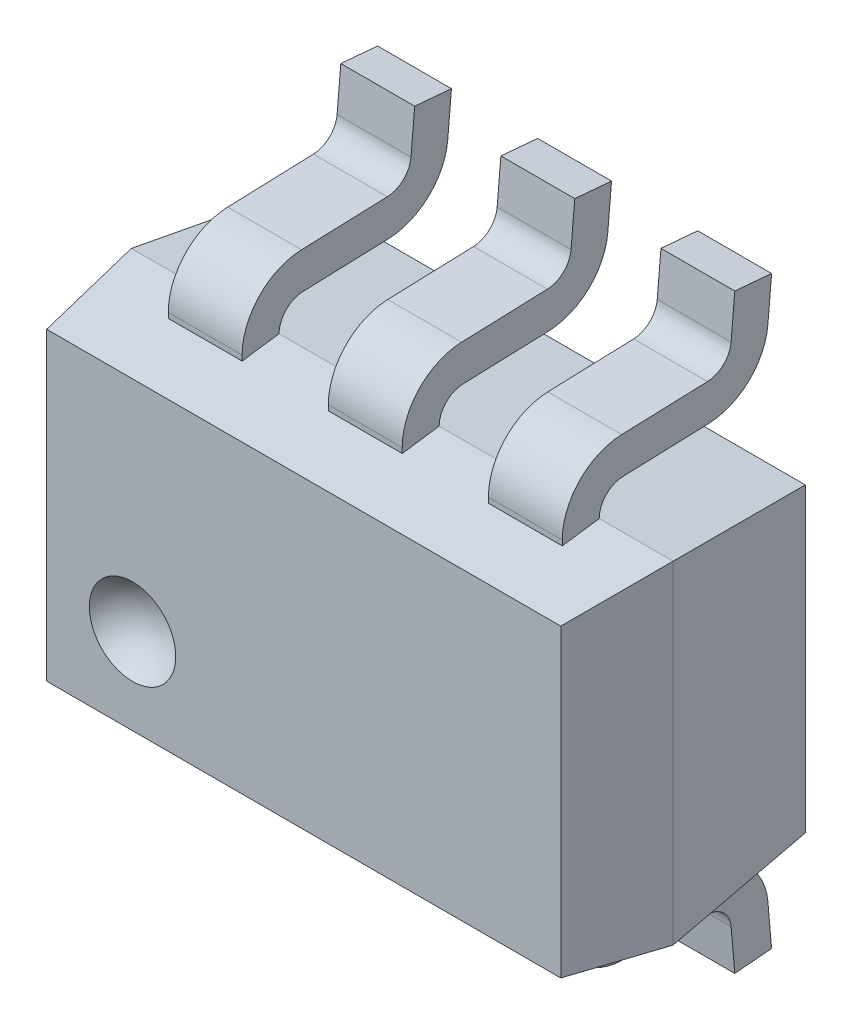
ISO-10303-21;
HEADER;
FILE_DESCRIPTION(('STEP AP214'),'2;1');
FILE_NAME('part.step','',(''),(''),'','','');
FILE_SCHEMA(('AUTOMOTIVE_DESIGN { 1 0 10303 214 1 1 1 1 }'));
ENDSEC;
DATA;
#1=APPLICATION_CONTEXT('core data for automotive mechanical design processes');
#2=APPLICATION_PROTOCOL_DEFINITION('international standard','automotive_design',2000,#1);
#3=PRODUCT_CONTEXT('',#1,'mechanical');
#4=PRODUCT('Part','Part','',(#3));
#5=PRODUCT_RELATED_PRODUCT_CATEGORY('part','',(#4));
#6=PRODUCT_DEFINITION_FORMATION('','',#4);
#7=PRODUCT_DEFINITION_CONTEXT('part definition',#1,'design');
#8=PRODUCT_DEFINITION('design','',#6,#7);
#9=PRODUCT_DEFINITION_SHAPE('','',#8);
#10=(LENGTH_UNIT() NAMED_UNIT(*) SI_UNIT(.MILLI.,.METRE.));
#11=(NAMED_UNIT(*) PLANE_ANGLE_UNIT() SI_UNIT($,.RADIAN.));
#12=(NAMED_UNIT(*) SI_UNIT($,.STERADIAN.) SOLID_ANGLE_UNIT());
#13=UNCERTAINTY_MEASURE_WITH_UNIT(LENGTH_MEASURE(1.E-05),#10,'distance_accuracy_value','');
#14=(GEOMETRIC_REPRESENTATION_CONTEXT(3) GLOBAL_UNCERTAINTY_ASSIGNED_CONTEXT((#13)) GLOBAL_UNIT_ASSIGNED_CONTEXT((#10,
#11,#12)) REPRESENTATION_CONTEXT('',''));
#15=CARTESIAN_POINT('',(0.,0.,0.));
#16=DIRECTION('',(0.,0.,1.));
#17=DIRECTION('',(1.,0.,0.));
#18=AXIS2_PLACEMENT_3D('',#15,#16,#17);
#19=CARTESIAN_POINT('',(1.1,0.675,1.1));
#20=DIRECTION('',(0.,0.,-1.));
#21=DIRECTION('',(-1.,0.,0.));
#22=AXIS2_PLACEMENT_3D('',#19,#20,#21);
#23=PLANE('',#22);
#24=DIRECTION('',(0.,1.,0.));
#25=VECTOR('',#24,1.);
#26=CARTESIAN_POINT('',(1.04378366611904,0.675,1.1));
#27=LINE('',#26,#25);
#28=CARTESIAN_POINT('',(1.04378366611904,-0.618783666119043,1.1));
#29=VERTEX_POINT('',#28);
#30=CARTESIAN_POINT('',(1.04378366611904,0.618783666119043,1.1));
#31=VERTEX_POINT('',#30);
#32=EDGE_CURVE('E849',#29,#31,#27,.T.);
#33=ORIENTED_EDGE('',*,*,#32,.T.);
#34=DIRECTION('',(-1.,0.,0.));
#35=VECTOR('',#34,1.);
#36=CARTESIAN_POINT('',(1.1,0.618783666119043,1.1));
#37=LINE('',#36,#35);
#38=CARTESIAN_POINT('',(-1.04378366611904,0.618783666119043,1.1));
#39=VERTEX_POINT('',#38);
#40=EDGE_CURVE('E851',#31,#39,#37,.T.);
#41=ORIENTED_EDGE('',*,*,#40,.T.);
#42=DIRECTION('',(0.,-1.,0.));
#43=VECTOR('',#42,1.);
#44=CARTESIAN_POINT('',(-1.04378366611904,0.675,1.1));
#45=LINE('',#44,#43);
#46=CARTESIAN_POINT('',(-1.04378366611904,-0.618783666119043,1.1));
#47=VERTEX_POINT('',#46);
#48=EDGE_CURVE('E844',#39,#47,#45,.T.);
#49=ORIENTED_EDGE('',*,*,#48,.T.);
#50=DIRECTION('',(1.,0.,0.));
#51=VECTOR('',#50,1.);
#52=CARTESIAN_POINT('',(1.1,-0.618783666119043,1.1));
#53=LINE('',#52,#51);
#54=EDGE_CURVE('E846',#47,#29,#53,.T.);
#55=ORIENTED_EDGE('',*,*,#54,.T.);
#56=EDGE_LOOP('',(#33,#41,#49,#55));
#57=FACE_BOUND('',#56,.T.);
#58=CARTESIAN_POINT('',(-0.695,-0.27,1.1));
#59=DIRECTION('',(0.,0.,-1.));
#60=DIRECTION('',(-1.,0.,0.));
#61=AXIS2_PLACEMENT_3D('',#58,#59,#60);
#62=CIRCLE('',#61,0.175370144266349);
#63=CARTESIAN_POINT('',(-0.870370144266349,-0.27,1.1));
#64=VERTEX_POINT('',#63);
#65=EDGE_CURVE('E40',#64,#64,#62,.F.);
#66=ORIENTED_EDGE('',*,*,#65,.F.);
#67=EDGE_LOOP('',(#66));
#68=FACE_BOUND('',#67,.T.);
#69=ADVANCED_FACE('F36',(#57,#68),#23,.F.);
#70=CARTESIAN_POINT('',(1.1,0.675,0.0999999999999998));
#71=DIRECTION('',(0.,0.,1.));
#72=DIRECTION('',(1.,0.,0.));
#73=AXIS2_PLACEMENT_3D('',#70,#71,#72);
#74=PLANE('',#73);
#75=DIRECTION('',(0.,-1.,0.));
#76=VECTOR('',#75,1.);
#77=CARTESIAN_POINT('',(1.03693745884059,-0.675,0.0999999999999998));
#78=LINE('',#77,#76);
#79=CARTESIAN_POINT('',(1.03693745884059,0.611937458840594,0.0999999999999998));
#80=VERTEX_POINT('',#79);
#81=CARTESIAN_POINT('',(1.03693745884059,-0.611937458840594,0.0999999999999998));
#82=VERTEX_POINT('',#81);
#83=EDGE_CURVE('E885',#80,#82,#78,.T.);
#84=ORIENTED_EDGE('',*,*,#83,.T.);
#85=DIRECTION('',(-1.,0.,0.));
#86=VECTOR('',#85,1.);
#87=CARTESIAN_POINT('',(1.1,-0.611937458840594,0.0999999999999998));
#88=LINE('',#87,#86);
#89=CARTESIAN_POINT('',(-1.03693745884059,-0.611937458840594,0.0999999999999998));
#90=VERTEX_POINT('',#89);
#91=EDGE_CURVE('E887',#82,#90,#88,.T.);
#92=ORIENTED_EDGE('',*,*,#91,.T.);
#93=DIRECTION('',(0.,1.,0.));
#94=VECTOR('',#93,1.);
#95=CARTESIAN_POINT('',(-1.03693745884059,0.675,0.0999999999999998));
#96=LINE('',#95,#94);
#97=CARTESIAN_POINT('',(-1.03693745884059,0.611937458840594,0.0999999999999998));
#98=VERTEX_POINT('',#97);
#99=EDGE_CURVE('E870',#90,#98,#96,.T.);
#100=ORIENTED_EDGE('',*,*,#99,.T.);
#101=DIRECTION('',(1.,0.,0.));
#102=VECTOR('',#101,1.);
#103=CARTESIAN_POINT('',(1.1,0.611937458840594,0.0999999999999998));
#104=LINE('',#103,#102);
#105=EDGE_CURVE('E883',#98,#80,#104,.T.);
#106=ORIENTED_EDGE('',*,*,#105,.T.);
#107=EDGE_LOOP('',(#84,#92,#100,#106));
#108=FACE_BOUND('',#107,.T.);
#109=ADVANCED_FACE('F971',(#108),#74,.F.);
#110=CARTESIAN_POINT('',(1.1,-0.675,0.69999999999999));
#111=DIRECTION('',(0.,0.990268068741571,-0.139173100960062));
#112=DIRECTION('',(0.,0.139173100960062,0.990268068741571));
#113=AXIS2_PLACEMENT_3D('',#110,#111,#112);
#114=PLANE('',#113);
#115=DIRECTION('',(0.,-0.139173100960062,-0.990268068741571));
#116=VECTOR('',#115,1.);
#117=CARTESIAN_POINT('',(0.8,-0.675,0.69999999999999));
#118=LINE('',#117,#116);
#119=CARTESIAN_POINT('',(0.8,-0.675000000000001,0.7));
#120=VERTEX_POINT('',#119);
#121=CARTESIAN_POINT('',(0.8,-0.653918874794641,0.849999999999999));
#122=VERTEX_POINT('',#121);
#123=EDGE_CURVE('E526',#120,#122,#118,.F.);
#124=ORIENTED_EDGE('',*,*,#123,.F.);
#125=DIRECTION('',(-1.,0.,0.));
#126=VECTOR('',#125,1.);
#127=CARTESIAN_POINT('',(1.1,-0.675,0.69999999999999));
#128=LINE('',#127,#126);
#129=CARTESIAN_POINT('',(1.1,-0.675,0.69999999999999));
#130=VERTEX_POINT('',#129);
#131=EDGE_CURVE('E863',#130,#120,#128,.T.);
#132=ORIENTED_EDGE('',*,*,#131,.F.);
#133=DIRECTION('',(0.137844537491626,-0.137844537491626,-0.98081484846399));
#134=VECTOR('',#133,1.);
#135=CARTESIAN_POINT('',(1.1,-0.675,0.69999999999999));
#136=LINE('',#135,#134);
#137=EDGE_CURVE('E847',#29,#130,#136,.T.);
#138=ORIENTED_EDGE('',*,*,#137,.F.);
#139=ORIENTED_EDGE('',*,*,#54,.F.);
#140=DIRECTION('',(0.137844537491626,0.137844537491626,0.98081484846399));
#141=VECTOR('',#140,1.);
#142=CARTESIAN_POINT('',(-1.01920033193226,-0.594200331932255,1.27491951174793));
#143=LINE('',#142,#141);
#144=CARTESIAN_POINT('',(-1.1,-0.675,0.69999999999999));
#145=VERTEX_POINT('',#144);
#146=EDGE_CURVE('E877',#145,#47,#143,.T.);
#147=ORIENTED_EDGE('',*,*,#146,.F.);
#148=CARTESIAN_POINT('',(-0.8,-0.675,0.69999999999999));
#149=VERTEX_POINT('',#148);
#150=EDGE_CURVE('E862',#149,#145,#128,.T.);
#151=ORIENTED_EDGE('',*,*,#150,.F.);
#152=DIRECTION('',(0.,-0.139173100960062,-0.990268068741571));
#153=VECTOR('',#152,1.);
#154=CARTESIAN_POINT('',(-0.8,-0.675,0.69999999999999));
#155=LINE('',#154,#153);
#156=CARTESIAN_POINT('',(-0.8,-0.653918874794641,0.849999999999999));
#157=VERTEX_POINT('',#156);
#158=EDGE_CURVE('E832',#149,#157,#155,.F.);
#159=ORIENTED_EDGE('',*,*,#158,.T.);
#160=DIRECTION('',(-1.,0.,0.));
#161=VECTOR('',#160,1.);
#162=CARTESIAN_POINT('',(1.1,-0.653918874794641,0.849999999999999));
#163=LINE('',#162,#161);
#164=CARTESIAN_POINT('',(-0.5,-0.653918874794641,0.849999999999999));
#165=VERTEX_POINT('',#164);
#166=EDGE_CURVE('E840',#157,#165,#163,.F.);
#167=ORIENTED_EDGE('',*,*,#166,.T.);
#168=DIRECTION('',(0.,-0.139173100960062,-0.990268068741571));
#169=VECTOR('',#168,1.);
#170=CARTESIAN_POINT('',(-0.5,-0.675,0.69999999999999));
#171=LINE('',#170,#169);
#172=CARTESIAN_POINT('',(-0.5,-0.675000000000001,0.7));
#173=VERTEX_POINT('',#172);
#174=EDGE_CURVE('E838',#173,#165,#171,.F.);
#175=ORIENTED_EDGE('',*,*,#174,.F.);
#176=CARTESIAN_POINT('',(-0.15,-0.675,0.69999999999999));
#177=VERTEX_POINT('',#176);
#178=EDGE_CURVE('E1041',#177,#173,#128,.T.);
#179=ORIENTED_EDGE('',*,*,#178,.F.);
#180=DIRECTION('',(0.,-0.139173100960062,-0.990268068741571));
#181=VECTOR('',#180,1.);
#182=CARTESIAN_POINT('',(-0.15,-0.675,0.69999999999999));
#183=LINE('',#182,#181);
#184=CARTESIAN_POINT('',(-0.15,-0.653918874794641,0.849999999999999));
#185=VERTEX_POINT('',#184);
#186=EDGE_CURVE('E676',#177,#185,#183,.F.);
#187=ORIENTED_EDGE('',*,*,#186,.T.);
#188=DIRECTION('',(-1.,0.,0.));
#189=VECTOR('',#188,1.);
#190=CARTESIAN_POINT('',(1.1,-0.653918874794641,0.849999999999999));
#191=LINE('',#190,#189);
#192=CARTESIAN_POINT('',(0.15,-0.653918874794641,0.849999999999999));
#193=VERTEX_POINT('',#192);
#194=EDGE_CURVE('E684',#185,#193,#191,.F.);
#195=ORIENTED_EDGE('',*,*,#194,.T.);
#196=DIRECTION('',(0.,-0.139173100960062,-0.990268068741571));
#197=VECTOR('',#196,1.);
#198=CARTESIAN_POINT('',(0.15,-0.675,0.69999999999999));
#199=LINE('',#198,#197);
#200=CARTESIAN_POINT('',(0.15,-0.675000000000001,0.7));
#201=VERTEX_POINT('',#200);
#202=EDGE_CURVE('E682',#201,#193,#199,.F.);
#203=ORIENTED_EDGE('',*,*,#202,.F.);
#204=CARTESIAN_POINT('',(0.5,-0.675,0.69999999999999));
#205=VERTEX_POINT('',#204);
#206=EDGE_CURVE('E867',#205,#201,#128,.T.);
#207=ORIENTED_EDGE('',*,*,#206,.F.);
#208=DIRECTION('',(0.,-0.139173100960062,-0.990268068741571));
#209=VECTOR('',#208,1.);
#210=CARTESIAN_POINT('',(0.5,-0.675,0.69999999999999));
#211=LINE('',#210,#209);
#212=CARTESIAN_POINT('',(0.5,-0.653918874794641,0.849999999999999));
#213=VERTEX_POINT('',#212);
#214=EDGE_CURVE('E516',#205,#213,#211,.F.);
#215=ORIENTED_EDGE('',*,*,#214,.T.);
#216=DIRECTION('',(-1.,0.,0.));
#217=VECTOR('',#216,1.);
#218=CARTESIAN_POINT('',(1.1,-0.653918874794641,0.849999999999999));
#219=LINE('',#218,#217);
#220=EDGE_CURVE('E528',#213,#122,#219,.F.);
#221=ORIENTED_EDGE('',*,*,#220,.T.);
#222=EDGE_LOOP('',(#124,#132,#138,#139,#147,#151,#159,#167,#175,#179,#187,#195,#203,#207,#215,#221));
#223=FACE_BOUND('',#222,.T.);
#224=ADVANCED_FACE('F977',(#223),#114,.F.);
#225=CARTESIAN_POINT('',(1.1,-0.675,0.69999999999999));
#226=DIRECTION('',(0.990268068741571,0.,0.139173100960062));
#227=DIRECTION('',(0.139173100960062,0.,-0.990268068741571));
#228=AXIS2_PLACEMENT_3D('',#225,#226,#227);
#229=PLANE('',#228);
#230=ORIENTED_EDGE('',*,*,#137,.T.);
#231=DIRECTION('',(0.,-1.,0.));
#232=VECTOR('',#231,1.);
#233=CARTESIAN_POINT('',(1.1,-0.675,0.69999999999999));
#234=LINE('',#233,#232);
#235=CARTESIAN_POINT('',(1.1,0.675,0.69999999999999));
#236=VERTEX_POINT('',#235);
#237=EDGE_CURVE('E858',#236,#130,#234,.T.);
#238=ORIENTED_EDGE('',*,*,#237,.F.);
#239=DIRECTION('',(0.137844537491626,0.137844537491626,-0.98081484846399));
#240=VECTOR('',#239,1.);
#241=CARTESIAN_POINT('',(1.07434849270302,0.649348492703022,0.882519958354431));
#242=LINE('',#241,#240);
#243=EDGE_CURVE('E873',#31,#236,#242,.T.);
#244=ORIENTED_EDGE('',*,*,#243,.F.);
#245=ORIENTED_EDGE('',*,*,#32,.F.);
#246=EDGE_LOOP('',(#230,#238,#244,#245));
#247=FACE_BOUND('',#246,.T.);
#248=ADVANCED_FACE('F988',(#247),#229,.T.);
#249=CARTESIAN_POINT('',(-1.04378366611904,0.675,1.1));
#250=DIRECTION('',(0.990268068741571,0.,-0.139173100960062));
#251=DIRECTION('',(-0.139173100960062,0.,-0.990268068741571));
#252=AXIS2_PLACEMENT_3D('',#249,#250,#251);
#253=PLANE('',#252);
#254=ORIENTED_EDGE('',*,*,#146,.T.);
#255=ORIENTED_EDGE('',*,*,#48,.F.);
#256=DIRECTION('',(-0.137844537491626,0.137844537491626,-0.98081484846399));
#257=VECTOR('',#256,1.);
#258=CARTESIAN_POINT('',(-1.04485183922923,0.619851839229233,1.09239955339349));
#259=LINE('',#258,#257);
#260=CARTESIAN_POINT('',(-1.1,0.675,0.69999999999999));
#261=VERTEX_POINT('',#260);
#262=EDGE_CURVE('E871',#261,#39,#259,.F.);
#263=ORIENTED_EDGE('',*,*,#262,.F.);
#264=DIRECTION('',(0.,1.,0.));
#265=VECTOR('',#264,1.);
#266=CARTESIAN_POINT('',(-1.1,-0.675,0.69999999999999));
#267=LINE('',#266,#265);
#268=EDGE_CURVE('E866',#145,#261,#267,.T.);
#269=ORIENTED_EDGE('',*,*,#268,.F.);
#270=EDGE_LOOP('',(#254,#255,#263,#269));
#271=FACE_BOUND('',#270,.T.);
#272=ADVANCED_FACE('F985',(#271),#253,.F.);
#273=CARTESIAN_POINT('',(1.1,0.618783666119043,1.1));
#274=DIRECTION('',(0.,-0.990268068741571,-0.139173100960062));
#275=DIRECTION('',(0.,0.139173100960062,-0.990268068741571));
#276=AXIS2_PLACEMENT_3D('',#273,#274,#275);
#277=PLANE('',#276);
#278=DIRECTION('',(0.,-0.139173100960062,0.990268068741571));
#279=VECTOR('',#278,1.);
#280=CARTESIAN_POINT('',(0.8,0.618783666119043,1.1));
#281=LINE('',#280,#279);
#282=CARTESIAN_POINT('',(0.8,0.653918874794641,0.849999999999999));
#283=VERTEX_POINT('',#282);
#284=CARTESIAN_POINT('',(0.8,0.675,0.69999999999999));
#285=VERTEX_POINT('',#284);
#286=EDGE_CURVE('E524',#283,#285,#281,.F.);
#287=ORIENTED_EDGE('',*,*,#286,.F.);
#288=DIRECTION('',(1.,0.,0.));
#289=VECTOR('',#288,1.);
#290=CARTESIAN_POINT('',(1.1,0.653918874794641,0.849999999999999));
#291=LINE('',#290,#289);
#292=CARTESIAN_POINT('',(0.5,0.653918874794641,0.849999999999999));
#293=VERTEX_POINT('',#292);
#294=EDGE_CURVE('E11',#283,#293,#291,.F.);
#295=ORIENTED_EDGE('',*,*,#294,.T.);
#296=DIRECTION('',(0.,-0.139173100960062,0.990268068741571));
#297=VECTOR('',#296,1.);
#298=CARTESIAN_POINT('',(0.5,0.618783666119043,1.1));
#299=LINE('',#298,#297);
#300=CARTESIAN_POINT('',(0.5,0.674999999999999,0.7));
#301=VERTEX_POINT('',#300);
#302=EDGE_CURVE('E513',#293,#301,#299,.F.);
#303=ORIENTED_EDGE('',*,*,#302,.T.);
#304=DIRECTION('',(1.,0.,0.));
#305=VECTOR('',#304,1.);
#306=CARTESIAN_POINT('',(1.1,0.675,0.69999999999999));
#307=LINE('',#306,#305);
#308=CARTESIAN_POINT('',(0.15,0.675,0.69999999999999));
#309=VERTEX_POINT('',#308);
#310=EDGE_CURVE('E1022',#309,#301,#307,.T.);
#311=ORIENTED_EDGE('',*,*,#310,.F.);
#312=DIRECTION('',(0.,-0.139173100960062,0.990268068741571));
#313=VECTOR('',#312,1.);
#314=CARTESIAN_POINT('',(0.15,0.618783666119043,1.1));
#315=LINE('',#314,#313);
#316=CARTESIAN_POINT('',(0.15,0.653918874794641,0.849999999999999));
#317=VERTEX_POINT('',#316);
#318=EDGE_CURVE('E679',#317,#309,#315,.F.);
#319=ORIENTED_EDGE('',*,*,#318,.F.);
#320=DIRECTION('',(1.,0.,0.));
#321=VECTOR('',#320,1.);
#322=CARTESIAN_POINT('',(1.1,0.653918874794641,0.849999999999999));
#323=LINE('',#322,#321);
#324=CARTESIAN_POINT('',(-0.15,0.653918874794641,0.849999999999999));
#325=VERTEX_POINT('',#324);
#326=EDGE_CURVE('E45',#317,#325,#323,.F.);
#327=ORIENTED_EDGE('',*,*,#326,.T.);
#328=DIRECTION('',(0.,-0.139173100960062,0.990268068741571));
#329=VECTOR('',#328,1.);
#330=CARTESIAN_POINT('',(-0.15,0.618783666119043,1.1));
#331=LINE('',#330,#329);
#332=CARTESIAN_POINT('',(-0.15,0.674999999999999,0.7));
#333=VERTEX_POINT('',#332);
#334=EDGE_CURVE('E673',#325,#333,#331,.F.);
#335=ORIENTED_EDGE('',*,*,#334,.T.);
#336=CARTESIAN_POINT('',(-0.5,0.675,0.69999999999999));
#337=VERTEX_POINT('',#336);
#338=EDGE_CURVE('E859',#337,#333,#307,.T.);
#339=ORIENTED_EDGE('',*,*,#338,.F.);
#340=DIRECTION('',(0.,-0.139173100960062,0.990268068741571));
#341=VECTOR('',#340,1.);
#342=CARTESIAN_POINT('',(-0.5,0.618783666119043,1.1));
#343=LINE('',#342,#341);
#344=CARTESIAN_POINT('',(-0.5,0.653918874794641,0.849999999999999));
#345=VERTEX_POINT('',#344);
#346=EDGE_CURVE('E835',#345,#337,#343,.F.);
#347=ORIENTED_EDGE('',*,*,#346,.F.);
#348=DIRECTION('',(1.,0.,0.));
#349=VECTOR('',#348,1.);
#350=CARTESIAN_POINT('',(1.1,0.653918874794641,0.849999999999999));
#351=LINE('',#350,#349);
#352=CARTESIAN_POINT('',(-0.8,0.653918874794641,0.849999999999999));
#353=VERTEX_POINT('',#352);
#354=EDGE_CURVE('E890',#345,#353,#351,.F.);
#355=ORIENTED_EDGE('',*,*,#354,.T.);
#356=DIRECTION('',(0.,-0.139173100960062,0.990268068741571));
#357=VECTOR('',#356,1.);
#358=CARTESIAN_POINT('',(-0.8,0.618783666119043,1.1));
#359=LINE('',#358,#357);
#360=CARTESIAN_POINT('',(-0.8,0.674999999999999,0.7));
#361=VERTEX_POINT('',#360);
#362=EDGE_CURVE('E829',#353,#361,#359,.F.);
#363=ORIENTED_EDGE('',*,*,#362,.T.);
#364=EDGE_CURVE('E855',#261,#361,#307,.T.);
#365=ORIENTED_EDGE('',*,*,#364,.F.);
#366=ORIENTED_EDGE('',*,*,#262,.T.);
#367=ORIENTED_EDGE('',*,*,#40,.F.);
#368=ORIENTED_EDGE('',*,*,#243,.T.);
#369=EDGE_CURVE('E854',#285,#236,#307,.T.);
#370=ORIENTED_EDGE('',*,*,#369,.F.);
#371=EDGE_LOOP('',(#287,#295,#303,#311,#319,#327,#335,#339,#347,#355,#363,#365,#366,#367,#368,#370));
#372=FACE_BOUND('',#371,.T.);
#373=ADVANCED_FACE('F905',(#372),#277,.F.);
#374=CARTESIAN_POINT('',(1.1,0.675,0.70000000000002));
#375=DIRECTION('',(0.,-0.994521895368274,0.10452846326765));
#376=DIRECTION('',(-1.,0.,0.));
#377=AXIS2_PLACEMENT_3D('',#374,#375,#376);
#378=PLANE('',#377);
#379=DIRECTION('',(0.103962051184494,-0.103962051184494,-0.989132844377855));
#380=VECTOR('',#379,1.);
#381=CARTESIAN_POINT('',(-1.03761904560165,0.612619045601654,0.106484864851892));
#382=LINE('',#381,#380);
#383=EDGE_CURVE('E894',#261,#98,#382,.T.);
#384=ORIENTED_EDGE('',*,*,#383,.F.);
#385=ORIENTED_EDGE('',*,*,#364,.T.);
#386=DIRECTION('',(-1.,0.,0.));
#387=VECTOR('',#386,1.);
#388=CARTESIAN_POINT('',(-0.5,0.674999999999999,0.7));
#389=LINE('',#388,#387);
#390=EDGE_CURVE('E815',#337,#361,#389,.T.);
#391=ORIENTED_EDGE('',*,*,#390,.F.);
#392=ORIENTED_EDGE('',*,*,#338,.T.);
#393=DIRECTION('',(-1.,0.,0.));
#394=VECTOR('',#393,1.);
#395=CARTESIAN_POINT('',(0.15,0.674999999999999,0.7));
#396=LINE('',#395,#394);
#397=EDGE_CURVE('E659',#309,#333,#396,.T.);
#398=ORIENTED_EDGE('',*,*,#397,.F.);
#399=ORIENTED_EDGE('',*,*,#310,.T.);
#400=DIRECTION('',(-1.,0.,0.));
#401=VECTOR('',#400,1.);
#402=CARTESIAN_POINT('',(0.8,0.674999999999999,0.7));
#403=LINE('',#402,#401);
#404=EDGE_CURVE('E1021',#285,#301,#403,.T.);
#405=ORIENTED_EDGE('',*,*,#404,.F.);
#406=ORIENTED_EDGE('',*,*,#369,.T.);
#407=DIRECTION('',(0.103962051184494,0.103962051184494,0.989132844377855));
#408=VECTOR('',#407,1.);
#409=CARTESIAN_POINT('',(1.1,0.675,0.70000000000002));
#410=LINE('',#409,#408);
#411=EDGE_CURVE('E874',#80,#236,#410,.T.);
#412=ORIENTED_EDGE('',*,*,#411,.F.);
#413=ORIENTED_EDGE('',*,*,#105,.F.);
#414=EDGE_LOOP('',(#384,#385,#391,#392,#398,#399,#405,#406,#412,#413));
#415=FACE_BOUND('',#414,.T.);
#416=ADVANCED_FACE('F38',(#415),#378,.F.);
#417=CARTESIAN_POINT('',(1.1,-0.675,0.70000000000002));
#418=DIRECTION('',(0.994521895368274,0.,-0.10452846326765));
#419=DIRECTION('',(0.,-1.,0.));
#420=AXIS2_PLACEMENT_3D('',#417,#418,#419);
#421=PLANE('',#420);
#422=ORIENTED_EDGE('',*,*,#411,.T.);
#423=ORIENTED_EDGE('',*,*,#237,.T.);
#424=DIRECTION('',(0.103962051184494,-0.103962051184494,0.989132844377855));
#425=VECTOR('',#424,1.);
#426=CARTESIAN_POINT('',(1.1,-0.675,0.70000000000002));
#427=LINE('',#426,#425);
#428=EDGE_CURVE('E892',#82,#130,#427,.T.);
#429=ORIENTED_EDGE('',*,*,#428,.F.);
#430=ORIENTED_EDGE('',*,*,#83,.F.);
#431=EDGE_LOOP('',(#422,#423,#429,#430));
#432=FACE_BOUND('',#431,.T.);
#433=ADVANCED_FACE('F1003',(#432),#421,.T.);
#434=CARTESIAN_POINT('',(-1.03693745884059,0.675,0.0999999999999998));
#435=DIRECTION('',(0.994521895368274,0.,0.10452846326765));
#436=DIRECTION('',(0.,1.,0.));
#437=AXIS2_PLACEMENT_3D('',#434,#435,#436);
#438=PLANE('',#437);
#439=ORIENTED_EDGE('',*,*,#383,.T.);
#440=ORIENTED_EDGE('',*,*,#99,.F.);
#441=DIRECTION('',(-0.103962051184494,-0.103962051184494,0.989132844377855));
#442=VECTOR('',#441,1.);
#443=CARTESIAN_POINT('',(-1.0230280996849,-0.598028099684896,-0.0323387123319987));
#444=LINE('',#443,#442);
#445=EDGE_CURVE('E843',#145,#90,#444,.F.);
#446=ORIENTED_EDGE('',*,*,#445,.F.);
#447=ORIENTED_EDGE('',*,*,#268,.T.);
#448=EDGE_LOOP('',(#439,#440,#446,#447));
#449=FACE_BOUND('',#448,.T.);
#450=ADVANCED_FACE('F1000',(#449),#438,.F.);
#451=CARTESIAN_POINT('',(1.1,-0.611937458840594,0.0999999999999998));
#452=DIRECTION('',(0.,0.994521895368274,0.10452846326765));
#453=DIRECTION('',(-1.,0.,0.));
#454=AXIS2_PLACEMENT_3D('',#451,#452,#453);
#455=PLANE('',#454);
#456=ORIENTED_EDGE('',*,*,#428,.T.);
#457=ORIENTED_EDGE('',*,*,#131,.T.);
#458=DIRECTION('',(-1.,0.,0.));
#459=VECTOR('',#458,1.);
#460=CARTESIAN_POINT('',(0.8,-0.675000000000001,0.7));
#461=LINE('',#460,#459);
#462=EDGE_CURVE('E1031',#120,#205,#461,.T.);
#463=ORIENTED_EDGE('',*,*,#462,.T.);
#464=ORIENTED_EDGE('',*,*,#206,.T.);
#465=DIRECTION('',(-1.,0.,0.));
#466=VECTOR('',#465,1.);
#467=CARTESIAN_POINT('',(0.15,-0.675000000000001,0.7));
#468=LINE('',#467,#466);
#469=EDGE_CURVE('E661',#201,#177,#468,.T.);
#470=ORIENTED_EDGE('',*,*,#469,.T.);
#471=ORIENTED_EDGE('',*,*,#178,.T.);
#472=DIRECTION('',(-1.,0.,0.));
#473=VECTOR('',#472,1.);
#474=CARTESIAN_POINT('',(-0.5,-0.675000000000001,0.7));
#475=LINE('',#474,#473);
#476=EDGE_CURVE('E817',#173,#149,#475,.T.);
#477=ORIENTED_EDGE('',*,*,#476,.T.);
#478=ORIENTED_EDGE('',*,*,#150,.T.);
#479=ORIENTED_EDGE('',*,*,#445,.T.);
#480=ORIENTED_EDGE('',*,*,#91,.F.);
#481=EDGE_LOOP('',(#456,#457,#463,#464,#470,#471,#477,#478,#479,#480));
#482=FACE_BOUND('',#481,.T.);
#483=ADVANCED_FACE('F996',(#482),#455,.F.);
#484=CARTESIAN_POINT('',(-0.5,-1.18692663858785,0.));
#485=DIRECTION('',(0.,0.996194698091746,0.0871557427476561));
#486=DIRECTION('',(0.,-0.0871557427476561,0.996194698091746));
#487=AXIS2_PLACEMENT_3D('',#484,#485,#486);
#488=PLANE('',#487);
#489=DIRECTION('',(0.,0.0871557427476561,-0.996194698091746));
#490=VECTOR('',#489,1.);
#491=CARTESIAN_POINT('',(-0.8,-1.18692663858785,0.));
#492=LINE('',#491,#490);
#493=CARTESIAN_POINT('',(-0.8,-1.2,0.149429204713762));
#494=VERTEX_POINT('',#493);
#495=CARTESIAN_POINT('',(-0.8,-1.18692663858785,0.));
#496=VERTEX_POINT('',#495);
#497=EDGE_CURVE('E692',#494,#496,#492,.T.);
#498=ORIENTED_EDGE('',*,*,#497,.T.);
#499=DIRECTION('',(-1.,0.,0.));
#500=VECTOR('',#499,1.);
#501=CARTESIAN_POINT('',(-0.5,-1.18692663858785,0.));
#502=LINE('',#501,#500);
#503=CARTESIAN_POINT('',(-0.5,-1.18692663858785,0.));
#504=VERTEX_POINT('',#503);
#505=EDGE_CURVE('E731',#504,#496,#502,.T.);
#506=ORIENTED_EDGE('',*,*,#505,.F.);
#507=DIRECTION('',(0.,0.0871557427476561,-0.996194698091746));
#508=VECTOR('',#507,1.);
#509=CARTESIAN_POINT('',(-0.5,-1.18692663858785,0.));
#510=LINE('',#509,#508);
#511=CARTESIAN_POINT('',(-0.5,-1.2,0.149429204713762));
#512=VERTEX_POINT('',#511);
#513=EDGE_CURVE('E729',#512,#504,#510,.T.);
#514=ORIENTED_EDGE('',*,*,#513,.F.);
#515=DIRECTION('',(-1.,0.,0.));
#516=VECTOR('',#515,1.);
#517=CARTESIAN_POINT('',(-0.5,-1.2,0.149429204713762));
#518=LINE('',#517,#516);
#519=EDGE_CURVE('E773',#512,#494,#518,.T.);
#520=ORIENTED_EDGE('',*,*,#519,.T.);
#521=EDGE_LOOP('',(#498,#506,#514,#520));
#522=FACE_BOUND('',#521,.T.);
#523=ADVANCED_FACE('F999',(#522),#488,.F.);
#524=CARTESIAN_POINT('',(-0.5,-1.2,0.149429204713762));
#525=DIRECTION('',(0.,0.0871557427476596,-0.996194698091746));
#526=DIRECTION('',(0.,0.996194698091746,0.0871557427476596));
#527=AXIS2_PLACEMENT_3D('',#524,#525,#526);
#528=PLANE('',#527);
#529=DIRECTION('',(0.,-0.996194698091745,-0.0871557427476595));
#530=VECTOR('',#529,1.);
#531=CARTESIAN_POINT('',(-0.8,-1.2,0.149429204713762));
#532=LINE('',#531,#530);
#533=CARTESIAN_POINT('',(-0.8,-1.02822846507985,0.164457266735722));
#534=VERTEX_POINT('',#533);
#535=EDGE_CURVE('E768',#534,#494,#532,.T.);
#536=ORIENTED_EDGE('',*,*,#535,.T.);
#537=ORIENTED_EDGE('',*,*,#519,.F.);
#538=DIRECTION('',(0.,-0.996194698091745,-0.0871557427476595));
#539=VECTOR('',#538,1.);
#540=CARTESIAN_POINT('',(-0.5,-1.2,0.149429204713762));
#541=LINE('',#540,#539);
#542=CARTESIAN_POINT('',(-0.5,-1.02822846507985,0.164457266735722));
#543=VERTEX_POINT('',#542);
#544=EDGE_CURVE('E727',#543,#512,#541,.T.);
#545=ORIENTED_EDGE('',*,*,#544,.F.);
#546=DIRECTION('',(-1.,0.,0.));
#547=VECTOR('',#546,1.);
#548=CARTESIAN_POINT('',(-0.5,-1.02822846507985,0.164457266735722));
#549=LINE('',#548,#547);
#550=EDGE_CURVE('E776',#543,#534,#549,.T.);
#551=ORIENTED_EDGE('',*,*,#550,.T.);
#552=EDGE_LOOP('',(#536,#537,#545,#551));
#553=FACE_BOUND('',#552,.T.);
#554=ADVANCED_FACE('F1075',(#553),#528,.F.);
#555=CARTESIAN_POINT('',(-0.5,-1.03694403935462,0.264076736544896));
#556=DIRECTION('',(-1.,0.,0.));
#557=DIRECTION('',(0.,0.,1.));
#558=AXIS2_PLACEMENT_3D('',#555,#556,#557);
#559=CYLINDRICAL_SURFACE('',#558,0.0999999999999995);
#560=CARTESIAN_POINT('',(-0.8,-1.03694403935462,0.264076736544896));
#561=DIRECTION('',(-1.,0.,0.));
#562=DIRECTION('',(0.,0.,-1.));
#563=AXIS2_PLACEMENT_3D('',#560,#561,#562);
#564=CIRCLE('',#563,0.0999999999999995);
#565=CARTESIAN_POINT('',(-0.8,-0.937004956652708,0.260586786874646));
#566=VERTEX_POINT('',#565);
#567=EDGE_CURVE('E766',#566,#534,#564,.T.);
#568=ORIENTED_EDGE('',*,*,#567,.T.);
#569=ORIENTED_EDGE('',*,*,#550,.F.);
#570=CARTESIAN_POINT('',(-0.5,-1.03694403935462,0.264076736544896));
#571=DIRECTION('',(-1.,0.,0.));
#572=DIRECTION('',(0.,0.,-1.));
#573=AXIS2_PLACEMENT_3D('',#570,#571,#572);
#574=CIRCLE('',#573,0.0999999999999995);
#575=CARTESIAN_POINT('',(-0.5,-0.937004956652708,0.260586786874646));
#576=VERTEX_POINT('',#575);
#577=EDGE_CURVE('E725',#576,#543,#574,.T.);
#578=ORIENTED_EDGE('',*,*,#577,.F.);
#579=DIRECTION('',(-1.,0.,0.));
#580=VECTOR('',#579,1.);
#581=CARTESIAN_POINT('',(-0.5,-0.937004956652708,0.260586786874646));
#582=LINE('',#581,#580);
#583=EDGE_CURVE('E779',#576,#566,#582,.T.);
#584=ORIENTED_EDGE('',*,*,#583,.T.);
#585=EDGE_LOOP('',(#568,#569,#578,#584));
#586=FACE_BOUND('',#585,.T.);
#587=ADVANCED_FACE('F1070',(#586),#559,.F.);
#588=CARTESIAN_POINT('',(-0.5,-0.937004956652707,0.260586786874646));
#589=DIRECTION('',(0.,0.999390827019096,-0.0348994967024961));
#590=DIRECTION('',(0.,0.0348994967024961,0.999390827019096));
#591=AXIS2_PLACEMENT_3D('',#588,#589,#590);
#592=PLANE('',#591);
#593=DIRECTION('',(0.,-0.0348994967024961,-0.999390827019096));
#594=VECTOR('',#593,1.);
#595=CARTESIAN_POINT('',(-0.8,-0.937004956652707,0.260586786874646));
#596=LINE('',#595,#594);
#597=CARTESIAN_POINT('',(-0.8,-0.924847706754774,0.608724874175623));
#598=VERTEX_POINT('',#597);
#599=EDGE_CURVE('E764',#598,#566,#596,.T.);
#600=ORIENTED_EDGE('',*,*,#599,.T.);
#601=ORIENTED_EDGE('',*,*,#583,.F.);
#602=DIRECTION('',(0.,-0.0348994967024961,-0.999390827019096));
#603=VECTOR('',#602,1.);
#604=CARTESIAN_POINT('',(-0.5,-0.937004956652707,0.260586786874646));
#605=LINE('',#604,#603);
#606=CARTESIAN_POINT('',(-0.5,-0.924847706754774,0.608724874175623));
#607=VERTEX_POINT('',#606);
#608=EDGE_CURVE('E723',#607,#576,#605,.T.);
#609=ORIENTED_EDGE('',*,*,#608,.F.);
#610=DIRECTION('',(-1.,0.,0.));
#611=VECTOR('',#610,1.);
#612=CARTESIAN_POINT('',(-0.5,-0.924847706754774,0.608724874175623));
#613=LINE('',#612,#611);
#614=EDGE_CURVE('E782',#607,#598,#613,.T.);
#615=ORIENTED_EDGE('',*,*,#614,.T.);
#616=EDGE_LOOP('',(#600,#601,#609,#615));
#617=FACE_BOUND('',#616,.T.);
#618=ADVANCED_FACE('F1066',(#617),#592,.F.);
#619=CARTESIAN_POINT('',(-0.5,-0.675000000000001,0.6));
#620=DIRECTION('',(-1.,0.,0.));
#621=DIRECTION('',(0.,0.,1.));
#622=AXIS2_PLACEMENT_3D('',#619,#620,#621);
#623=CYLINDRICAL_SURFACE('',#622,0.249999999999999);
#624=CARTESIAN_POINT('',(-0.8,-0.675000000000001,0.6));
#625=DIRECTION('',(1.,0.,0.));
#626=DIRECTION('',(0.,0.,1.));
#627=AXIS2_PLACEMENT_3D('',#624,#625,#626);
#628=CIRCLE('',#627,0.249999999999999);
#629=CARTESIAN_POINT('',(-0.8,-0.675,0.849999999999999));
#630=VERTEX_POINT('',#629);
#631=EDGE_CURVE('E762',#630,#598,#628,.T.);
#632=ORIENTED_EDGE('',*,*,#631,.T.);
#633=ORIENTED_EDGE('',*,*,#614,.F.);
#634=CARTESIAN_POINT('',(-0.5,-0.675000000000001,0.6));
#635=DIRECTION('',(1.,0.,0.));
#636=DIRECTION('',(0.,0.,1.));
#637=AXIS2_PLACEMENT_3D('',#634,#635,#636);
#638=CIRCLE('',#637,0.249999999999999);
#639=CARTESIAN_POINT('',(-0.5,-0.675,0.849999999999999));
#640=VERTEX_POINT('',#639);
#641=EDGE_CURVE('E721',#640,#607,#638,.T.);
#642=ORIENTED_EDGE('',*,*,#641,.F.);
#643=DIRECTION('',(-1.,0.,0.));
#644=VECTOR('',#643,1.);
#645=CARTESIAN_POINT('',(-0.5,-0.675,0.849999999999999));
#646=LINE('',#645,#644);
#647=EDGE_CURVE('E785',#640,#630,#646,.T.);
#648=ORIENTED_EDGE('',*,*,#647,.T.);
#649=EDGE_LOOP('',(#632,#633,#642,#648));
#650=FACE_BOUND('',#649,.T.);
#651=ADVANCED_FACE('F1060',(#650),#623,.T.);
#652=CARTESIAN_POINT('',(-0.5,-0.675000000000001,0.6));
#653=DIRECTION('',(-1.,0.,0.));
#654=DIRECTION('',(0.,0.,1.));
#655=AXIS2_PLACEMENT_3D('',#652,#653,#654);
#656=CYLINDRICAL_SURFACE('',#655,0.1);
#657=CARTESIAN_POINT('',(-0.8,-0.675000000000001,0.6));
#658=DIRECTION('',(-1.,0.,0.));
#659=DIRECTION('',(0.,0.,-1.));
#660=AXIS2_PLACEMENT_3D('',#657,#658,#659);
#661=CIRCLE('',#660,0.1);
#662=CARTESIAN_POINT('',(-0.8,-0.774939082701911,0.603489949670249));
#663=VERTEX_POINT('',#662);
#664=EDGE_CURVE('E738',#663,#149,#661,.T.);
#665=ORIENTED_EDGE('',*,*,#664,.T.);
#666=ORIENTED_EDGE('',*,*,#476,.F.);
#667=CARTESIAN_POINT('',(-0.5,-0.675000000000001,0.6));
#668=DIRECTION('',(-1.,0.,0.));
#669=DIRECTION('',(0.,0.,-1.));
#670=AXIS2_PLACEMENT_3D('',#667,#668,#669);
#671=CIRCLE('',#670,0.1);
#672=CARTESIAN_POINT('',(-0.5,-0.774939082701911,0.603489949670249));
#673=VERTEX_POINT('',#672);
#674=EDGE_CURVE('E696',#673,#173,#671,.T.);
#675=ORIENTED_EDGE('',*,*,#674,.F.);
#676=DIRECTION('',(-1.,0.,0.));
#677=VECTOR('',#676,1.);
#678=CARTESIAN_POINT('',(-0.5,-0.774939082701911,0.603489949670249));
#679=LINE('',#678,#677);
#680=EDGE_CURVE('E820',#673,#663,#679,.T.);
#681=ORIENTED_EDGE('',*,*,#680,.T.);
#682=EDGE_LOOP('',(#665,#666,#675,#681));
#683=FACE_BOUND('',#682,.T.);
#684=ADVANCED_FACE('F1047',(#683),#656,.F.);
#685=CARTESIAN_POINT('',(-0.5,-0.774939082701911,0.603489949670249));
#686=DIRECTION('',(0.,-0.999390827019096,0.0348994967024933));
#687=DIRECTION('',(0.,-0.0348994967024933,-0.999390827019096));
#688=AXIS2_PLACEMENT_3D('',#685,#686,#687);
#689=PLANE('',#688);
#690=DIRECTION('',(0.,0.0348994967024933,0.999390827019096));
#691=VECTOR('',#690,1.);
#692=CARTESIAN_POINT('',(-0.8,-0.774939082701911,0.603489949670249));
#693=LINE('',#692,#691);
#694=CARTESIAN_POINT('',(-0.8,-0.787096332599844,0.255351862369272));
#695=VERTEX_POINT('',#694);
#696=EDGE_CURVE('E736',#695,#663,#693,.T.);
#697=ORIENTED_EDGE('',*,*,#696,.T.);
#698=ORIENTED_EDGE('',*,*,#680,.F.);
#699=DIRECTION('',(0.,0.0348994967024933,0.999390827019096));
#700=VECTOR('',#699,1.);
#701=CARTESIAN_POINT('',(-0.5,-0.774939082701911,0.603489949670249));
#702=LINE('',#701,#700);
#703=CARTESIAN_POINT('',(-0.5,-0.787096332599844,0.255351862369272));
#704=VERTEX_POINT('',#703);
#705=EDGE_CURVE('E694',#704,#673,#702,.T.);
#706=ORIENTED_EDGE('',*,*,#705,.F.);
#707=DIRECTION('',(-1.,0.,0.));
#708=VECTOR('',#707,1.);
#709=CARTESIAN_POINT('',(-0.5,-0.787096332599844,0.255351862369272));
#710=LINE('',#709,#708);
#711=EDGE_CURVE('E823',#704,#695,#710,.T.);
#712=ORIENTED_EDGE('',*,*,#711,.T.);
#713=EDGE_LOOP('',(#697,#698,#706,#712));
#714=FACE_BOUND('',#713,.T.);
#715=ADVANCED_FACE('F1091',(#714),#689,.F.);
#716=CARTESIAN_POINT('',(-0.5,-1.03694403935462,0.264076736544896));
#717=DIRECTION('',(-1.,0.,0.));
#718=DIRECTION('',(0.,0.,1.));
#719=AXIS2_PLACEMENT_3D('',#716,#717,#718);
#720=CYLINDRICAL_SURFACE('',#719,0.249999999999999);
#721=CARTESIAN_POINT('',(-0.8,-1.03694403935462,0.264076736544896));
#722=DIRECTION('',(1.,0.,0.));
#723=DIRECTION('',(0.,0.,1.));
#724=AXIS2_PLACEMENT_3D('',#721,#722,#723);
#725=CIRCLE('',#724,0.249999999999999);
#726=CARTESIAN_POINT('',(-0.8,-1.0151551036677,0.0150280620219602));
#727=VERTEX_POINT('',#726);
#728=EDGE_CURVE('E734',#727,#695,#725,.T.);
#729=ORIENTED_EDGE('',*,*,#728,.T.);
#730=ORIENTED_EDGE('',*,*,#711,.F.);
#731=CARTESIAN_POINT('',(-0.5,-1.03694403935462,0.264076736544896));
#732=DIRECTION('',(1.,0.,0.));
#733=DIRECTION('',(0.,0.,1.));
#734=AXIS2_PLACEMENT_3D('',#731,#732,#733);
#735=CIRCLE('',#734,0.249999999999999);
#736=CARTESIAN_POINT('',(-0.5,-1.0151551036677,0.0150280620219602));
#737=VERTEX_POINT('',#736);
#738=EDGE_CURVE('E691',#737,#704,#735,.T.);
#739=ORIENTED_EDGE('',*,*,#738,.F.);
#740=DIRECTION('',(-1.,0.,0.));
#741=VECTOR('',#740,1.);
#742=CARTESIAN_POINT('',(-0.5,-1.0151551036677,0.0150280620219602));
#743=LINE('',#742,#741);
#744=EDGE_CURVE('E826',#737,#727,#743,.T.);
#745=ORIENTED_EDGE('',*,*,#744,.T.);
#746=EDGE_LOOP('',(#729,#730,#739,#745));
#747=FACE_BOUND('',#746,.T.);
#748=ADVANCED_FACE('F1086',(#747),#720,.T.);
#749=CARTESIAN_POINT('',(-0.5,-1.0151551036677,0.0150280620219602));
#750=DIRECTION('',(0.,-0.0871557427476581,0.996194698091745));
#751=DIRECTION('',(0.,-0.996194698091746,-0.0871557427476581));
#752=AXIS2_PLACEMENT_3D('',#749,#750,#751);
#753=PLANE('',#752);
#754=DIRECTION('',(0.,0.996194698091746,0.0871557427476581));
#755=VECTOR('',#754,1.);
#756=CARTESIAN_POINT('',(-0.8,-1.0151551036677,0.0150280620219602));
#757=LINE('',#756,#755);
#758=EDGE_CURVE('E687',#496,#727,#757,.T.);
#759=ORIENTED_EDGE('',*,*,#758,.T.);
#760=ORIENTED_EDGE('',*,*,#744,.F.);
#761=DIRECTION('',(0.,0.996194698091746,0.0871557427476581));
#762=VECTOR('',#761,1.);
#763=CARTESIAN_POINT('',(-0.5,-1.0151551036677,0.0150280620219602));
#764=LINE('',#763,#762);
#765=EDGE_CURVE('E688',#504,#737,#764,.T.);
#766=ORIENTED_EDGE('',*,*,#765,.F.);
#767=ORIENTED_EDGE('',*,*,#505,.T.);
#768=EDGE_LOOP('',(#759,#760,#766,#767));
#769=FACE_BOUND('',#768,.T.);
#770=ADVANCED_FACE('F1084',(#769),#753,.F.);
#771=CARTESIAN_POINT('',(-0.8,-1.03694403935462,0.264076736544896));
#772=DIRECTION('',(1.,0.,0.));
#773=DIRECTION('',(0.,0.,-1.));
#774=AXIS2_PLACEMENT_3D('',#771,#772,#773);
#775=PLANE('',#774);
#776=ORIENTED_EDGE('',*,*,#158,.F.);
#777=ORIENTED_EDGE('',*,*,#664,.F.);
#778=ORIENTED_EDGE('',*,*,#696,.F.);
#779=ORIENTED_EDGE('',*,*,#728,.F.);
#780=ORIENTED_EDGE('',*,*,#758,.F.);
#781=ORIENTED_EDGE('',*,*,#497,.F.);
#782=ORIENTED_EDGE('',*,*,#535,.F.);
#783=ORIENTED_EDGE('',*,*,#567,.F.);
#784=ORIENTED_EDGE('',*,*,#599,.F.);
#785=ORIENTED_EDGE('',*,*,#631,.F.);
#786=DIRECTION('',(0.,-1.,0.));
#787=VECTOR('',#786,1.);
#788=CARTESIAN_POINT('',(-0.8,-0.675,0.849999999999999));
#789=LINE('',#788,#787);
#790=EDGE_CURVE('E758',#157,#630,#789,.T.);
#791=ORIENTED_EDGE('',*,*,#790,.F.);
#792=EDGE_LOOP('',(#776,#777,#778,#779,#780,#781,#782,#783,#784,#785,#791));
#793=FACE_BOUND('',#792,.T.);
#794=ADVANCED_FACE('F1094',(#793),#775,.F.);
#795=CARTESIAN_POINT('',(-0.5,-1.03694403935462,0.264076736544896));
#796=DIRECTION('',(1.,0.,0.));
#797=DIRECTION('',(0.,0.,-1.));
#798=AXIS2_PLACEMENT_3D('',#795,#796,#797);
#799=PLANE('',#798);
#800=ORIENTED_EDGE('',*,*,#674,.T.);
#801=ORIENTED_EDGE('',*,*,#174,.T.);
#802=DIRECTION('',(0.,-1.,0.));
#803=VECTOR('',#802,1.);
#804=CARTESIAN_POINT('',(-0.5,-0.675,0.849999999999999));
#805=LINE('',#804,#803);
#806=EDGE_CURVE('E717',#165,#640,#805,.T.);
#807=ORIENTED_EDGE('',*,*,#806,.T.);
#808=ORIENTED_EDGE('',*,*,#641,.T.);
#809=ORIENTED_EDGE('',*,*,#608,.T.);
#810=ORIENTED_EDGE('',*,*,#577,.T.);
#811=ORIENTED_EDGE('',*,*,#544,.T.);
#812=ORIENTED_EDGE('',*,*,#513,.T.);
#813=ORIENTED_EDGE('',*,*,#765,.T.);
#814=ORIENTED_EDGE('',*,*,#738,.T.);
#815=ORIENTED_EDGE('',*,*,#705,.T.);
#816=EDGE_LOOP('',(#800,#801,#807,#808,#809,#810,#811,#812,#813,#814,#815));
#817=FACE_BOUND('',#816,.T.);
#818=ADVANCED_FACE('F1051',(#817),#799,.T.);
#819=CARTESIAN_POINT('',(-0.5,-0.675,0.849999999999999));
#820=DIRECTION('',(0.,0.,-1.));
#821=DIRECTION('',(-1.,0.,0.));
#822=AXIS2_PLACEMENT_3D('',#819,#820,#821);
#823=PLANE('',#822);
#824=ORIENTED_EDGE('',*,*,#166,.F.);
#825=ORIENTED_EDGE('',*,*,#790,.T.);
#826=ORIENTED_EDGE('',*,*,#647,.F.);
#827=ORIENTED_EDGE('',*,*,#806,.F.);
#828=EDGE_LOOP('',(#824,#825,#826,#827));
#829=FACE_BOUND('',#828,.T.);
#830=ADVANCED_FACE('F1054',(#829),#823,.F.);
#831=CARTESIAN_POINT('',(-0.5,0.675000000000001,0.6));
#832=DIRECTION('',(-1.,0.,0.));
#833=DIRECTION('',(0.,0.,1.));
#834=AXIS2_PLACEMENT_3D('',#831,#832,#833);
#835=CYLINDRICAL_SURFACE('',#834,0.1);
#836=CARTESIAN_POINT('',(-0.8,0.675000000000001,0.6));
#837=DIRECTION('',(-1.,0.,0.));
#838=DIRECTION('',(0.,0.,-1.));
#839=AXIS2_PLACEMENT_3D('',#836,#837,#838);
#840=CIRCLE('',#839,0.1);
#841=CARTESIAN_POINT('',(-0.8,0.774939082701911,0.603489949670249));
#842=VERTEX_POINT('',#841);
#843=EDGE_CURVE('E740',#361,#842,#840,.T.);
#844=ORIENTED_EDGE('',*,*,#843,.T.);
#845=DIRECTION('',(-1.,0.,0.));
#846=VECTOR('',#845,1.);
#847=CARTESIAN_POINT('',(-0.5,0.774939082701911,0.603489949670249));
#848=LINE('',#847,#846);
#849=CARTESIAN_POINT('',(-0.5,0.774939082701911,0.603489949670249));
#850=VERTEX_POINT('',#849);
#851=EDGE_CURVE('E812',#850,#842,#848,.T.);
#852=ORIENTED_EDGE('',*,*,#851,.F.);
#853=CARTESIAN_POINT('',(-0.5,0.675000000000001,0.6));
#854=DIRECTION('',(-1.,0.,0.));
#855=DIRECTION('',(0.,0.,-1.));
#856=AXIS2_PLACEMENT_3D('',#853,#854,#855);
#857=CIRCLE('',#856,0.1);
#858=EDGE_CURVE('E699',#337,#850,#857,.T.);
#859=ORIENTED_EDGE('',*,*,#858,.F.);
#860=ORIENTED_EDGE('',*,*,#390,.T.);
#861=EDGE_LOOP('',(#844,#852,#859,#860));
#862=FACE_BOUND('',#861,.T.);
#863=ADVANCED_FACE('F1164',(#862),#835,.F.);
#864=CARTESIAN_POINT('',(-0.5,0.787096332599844,0.255351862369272));
#865=DIRECTION('',(0.,0.999390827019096,0.0348994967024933));
#866=DIRECTION('',(0.,-0.0348994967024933,0.999390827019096));
#867=AXIS2_PLACEMENT_3D('',#864,#865,#866);
#868=PLANE('',#867);
#869=DIRECTION('',(0.,0.0348994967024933,-0.999390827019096));
#870=VECTOR('',#869,1.);
#871=CARTESIAN_POINT('',(-0.8,0.787096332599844,0.255351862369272));
#872=LINE('',#871,#870);
#873=CARTESIAN_POINT('',(-0.8,0.787096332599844,0.255351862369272));
#874=VERTEX_POINT('',#873);
#875=EDGE_CURVE('E742',#842,#874,#872,.T.);
#876=ORIENTED_EDGE('',*,*,#875,.T.);
#877=DIRECTION('',(-1.,0.,0.));
#878=VECTOR('',#877,1.);
#879=CARTESIAN_POINT('',(-0.5,0.787096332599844,0.255351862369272));
#880=LINE('',#879,#878);
#881=CARTESIAN_POINT('',(-0.5,0.787096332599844,0.255351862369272));
#882=VERTEX_POINT('',#881);
#883=EDGE_CURVE('E809',#882,#874,#880,.T.);
#884=ORIENTED_EDGE('',*,*,#883,.F.);
#885=DIRECTION('',(0.,0.0348994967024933,-0.999390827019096));
#886=VECTOR('',#885,1.);
#887=CARTESIAN_POINT('',(-0.5,0.787096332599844,0.255351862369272));
#888=LINE('',#887,#886);
#889=EDGE_CURVE('E701',#850,#882,#888,.T.);
#890=ORIENTED_EDGE('',*,*,#889,.F.);
#891=ORIENTED_EDGE('',*,*,#851,.T.);
#892=EDGE_LOOP('',(#876,#884,#890,#891));
#893=FACE_BOUND('',#892,.T.);
#894=ADVANCED_FACE('F1161',(#893),#868,.F.);
#895=CARTESIAN_POINT('',(-0.5,1.03694403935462,0.264076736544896));
#896=DIRECTION('',(-1.,0.,0.));
#897=DIRECTION('',(0.,0.,1.));
#898=AXIS2_PLACEMENT_3D('',#895,#896,#897);
#899=CYLINDRICAL_SURFACE('',#898,0.249999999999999);
#900=CARTESIAN_POINT('',(-0.8,1.03694403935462,0.264076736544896));
#901=DIRECTION('',(1.,0.,0.));
#902=DIRECTION('',(0.,0.,1.));
#903=AXIS2_PLACEMENT_3D('',#900,#901,#902);
#904=CIRCLE('',#903,0.249999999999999);
#905=CARTESIAN_POINT('',(-0.8,1.0151551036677,0.0150280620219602));
#906=VERTEX_POINT('',#905);
#907=EDGE_CURVE('E744',#874,#906,#904,.T.);
#908=ORIENTED_EDGE('',*,*,#907,.T.);
#909=DIRECTION('',(-1.,0.,0.));
#910=VECTOR('',#909,1.);
#911=CARTESIAN_POINT('',(-0.5,1.0151551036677,0.0150280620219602));
#912=LINE('',#911,#910);
#913=CARTESIAN_POINT('',(-0.5,1.0151551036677,0.0150280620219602));
#914=VERTEX_POINT('',#913);
#915=EDGE_CURVE('E806',#914,#906,#912,.T.);
#916=ORIENTED_EDGE('',*,*,#915,.F.);
#917=CARTESIAN_POINT('',(-0.5,1.03694403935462,0.264076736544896));
#918=DIRECTION('',(1.,0.,0.));
#919=DIRECTION('',(0.,0.,1.));
#920=AXIS2_PLACEMENT_3D('',#917,#918,#919);
#921=CIRCLE('',#920,0.249999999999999);
#922=EDGE_CURVE('E703',#882,#914,#921,.T.);
#923=ORIENTED_EDGE('',*,*,#922,.F.);
#924=ORIENTED_EDGE('',*,*,#883,.T.);
#925=EDGE_LOOP('',(#908,#916,#923,#924));
#926=FACE_BOUND('',#925,.T.);
#927=ADVANCED_FACE('F1158',(#926),#899,.T.);
#928=CARTESIAN_POINT('',(-0.5,1.18692663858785,0.));
#929=DIRECTION('',(0.,0.0871557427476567,0.996194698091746));
#930=DIRECTION('',(0.,-0.996194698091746,0.0871557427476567));
#931=AXIS2_PLACEMENT_3D('',#928,#929,#930);
#932=PLANE('',#931);
#933=DIRECTION('',(0.,0.996194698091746,-0.0871557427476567));
#934=VECTOR('',#933,1.);
#935=CARTESIAN_POINT('',(-0.8,1.18692663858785,0.));
#936=LINE('',#935,#934);
#937=CARTESIAN_POINT('',(-0.8,1.18692663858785,0.));
#938=VERTEX_POINT('',#937);
#939=EDGE_CURVE('E746',#906,#938,#936,.T.);
#940=ORIENTED_EDGE('',*,*,#939,.T.);
#941=DIRECTION('',(-1.,0.,0.));
#942=VECTOR('',#941,1.);
#943=CARTESIAN_POINT('',(-0.5,1.18692663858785,0.));
#944=LINE('',#943,#942);
#945=CARTESIAN_POINT('',(-0.5,1.18692663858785,0.));
#946=VERTEX_POINT('',#945);
#947=EDGE_CURVE('E803',#946,#938,#944,.T.);
#948=ORIENTED_EDGE('',*,*,#947,.F.);
#949=DIRECTION('',(0.,0.996194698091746,-0.0871557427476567));
#950=VECTOR('',#949,1.);
#951=CARTESIAN_POINT('',(-0.5,1.18692663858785,0.));
#952=LINE('',#951,#950);
#953=EDGE_CURVE('E705',#914,#946,#952,.T.);
#954=ORIENTED_EDGE('',*,*,#953,.F.);
#955=ORIENTED_EDGE('',*,*,#915,.T.);
#956=EDGE_LOOP('',(#940,#948,#954,#955));
#957=FACE_BOUND('',#956,.T.);
#958=ADVANCED_FACE('F1154',(#957),#932,.F.);
#959=CARTESIAN_POINT('',(-0.5,1.2,0.149429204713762));
#960=DIRECTION('',(0.,-0.996194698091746,0.0871557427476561));
#961=DIRECTION('',(0.,-0.0871557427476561,-0.996194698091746));
#962=AXIS2_PLACEMENT_3D('',#959,#960,#961);
#963=PLANE('',#962);
#964=DIRECTION('',(0.,0.0871557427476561,0.996194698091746));
#965=VECTOR('',#964,1.);
#966=CARTESIAN_POINT('',(-0.8,1.2,0.149429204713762));
#967=LINE('',#966,#965);
#968=CARTESIAN_POINT('',(-0.8,1.2,0.149429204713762));
#969=VERTEX_POINT('',#968);
#970=EDGE_CURVE('E748',#938,#969,#967,.T.);
#971=ORIENTED_EDGE('',*,*,#970,.T.);
#972=DIRECTION('',(-1.,0.,0.));
#973=VECTOR('',#972,1.);
#974=CARTESIAN_POINT('',(-0.5,1.2,0.149429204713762));
#975=LINE('',#974,#973);
#976=CARTESIAN_POINT('',(-0.5,1.2,0.149429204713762));
#977=VERTEX_POINT('',#976);
#978=EDGE_CURVE('E800',#977,#969,#975,.T.);
#979=ORIENTED_EDGE('',*,*,#978,.F.);
#980=DIRECTION('',(0.,0.0871557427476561,0.996194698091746));
#981=VECTOR('',#980,1.);
#982=CARTESIAN_POINT('',(-0.5,1.2,0.149429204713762));
#983=LINE('',#982,#981);
#984=EDGE_CURVE('E707',#946,#977,#983,.T.);
#985=ORIENTED_EDGE('',*,*,#984,.F.);
#986=ORIENTED_EDGE('',*,*,#947,.T.);
#987=EDGE_LOOP('',(#971,#979,#985,#986));
#988=FACE_BOUND('',#987,.T.);
#989=ADVANCED_FACE('F1149',(#988),#963,.F.);
#990=CARTESIAN_POINT('',(-0.5,1.02822846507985,0.164457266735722));
#991=DIRECTION('',(0.,-0.0871557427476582,-0.996194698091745));
#992=DIRECTION('',(0.,0.996194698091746,-0.0871557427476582));
#993=AXIS2_PLACEMENT_3D('',#990,#991,#992);
#994=PLANE('',#993);
#995=DIRECTION('',(0.,-0.996194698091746,0.0871557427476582));
#996=VECTOR('',#995,1.);
#997=CARTESIAN_POINT('',(-0.8,1.02822846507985,0.164457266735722));
#998=LINE('',#997,#996);
#999=CARTESIAN_POINT('',(-0.8,1.02822846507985,0.164457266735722));
#1000=VERTEX_POINT('',#999);
#1001=EDGE_CURVE('E750',#969,#1000,#998,.T.);
#1002=ORIENTED_EDGE('',*,*,#1001,.T.);
#1003=DIRECTION('',(-1.,0.,0.));
#1004=VECTOR('',#1003,1.);
#1005=CARTESIAN_POINT('',(-0.5,1.02822846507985,0.164457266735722));
#1006=LINE('',#1005,#1004);
#1007=CARTESIAN_POINT('',(-0.5,1.02822846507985,0.164457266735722));
#1008=VERTEX_POINT('',#1007);
#1009=EDGE_CURVE('E797',#1008,#1000,#1006,.T.);
#1010=ORIENTED_EDGE('',*,*,#1009,.F.);
#1011=DIRECTION('',(0.,-0.996194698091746,0.0871557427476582));
#1012=VECTOR('',#1011,1.);
#1013=CARTESIAN_POINT('',(-0.5,1.02822846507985,0.164457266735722));
#1014=LINE('',#1013,#1012);
#1015=EDGE_CURVE('E709',#977,#1008,#1014,.T.);
#1016=ORIENTED_EDGE('',*,*,#1015,.F.);
#1017=ORIENTED_EDGE('',*,*,#978,.T.);
#1018=EDGE_LOOP('',(#1002,#1010,#1016,#1017));
#1019=FACE_BOUND('',#1018,.T.);
#1020=ADVANCED_FACE('F1143',(#1019),#994,.F.);
#1021=CARTESIAN_POINT('',(-0.5,1.03694403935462,0.264076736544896));
#1022=DIRECTION('',(-1.,0.,0.));
#1023=DIRECTION('',(0.,0.,1.));
#1024=AXIS2_PLACEMENT_3D('',#1021,#1022,#1023);
#1025=CYLINDRICAL_SURFACE('',#1024,0.0999999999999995);
#1026=CARTESIAN_POINT('',(-0.8,1.03694403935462,0.264076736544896));
#1027=DIRECTION('',(-1.,0.,0.));
#1028=DIRECTION('',(0.,0.,-1.));
#1029=AXIS2_PLACEMENT_3D('',#1026,#1027,#1028);
#1030=CIRCLE('',#1029,0.0999999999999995);
#1031=CARTESIAN_POINT('',(-0.8,0.937004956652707,0.260586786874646));
#1032=VERTEX_POINT('',#1031);
#1033=EDGE_CURVE('E752',#1000,#1032,#1030,.T.);
#1034=ORIENTED_EDGE('',*,*,#1033,.T.);
#1035=DIRECTION('',(-1.,0.,0.));
#1036=VECTOR('',#1035,1.);
#1037=CARTESIAN_POINT('',(-0.5,0.937004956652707,0.260586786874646));
#1038=LINE('',#1037,#1036);
#1039=CARTESIAN_POINT('',(-0.5,0.937004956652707,0.260586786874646));
#1040=VERTEX_POINT('',#1039);
#1041=EDGE_CURVE('E794',#1040,#1032,#1038,.T.);
#1042=ORIENTED_EDGE('',*,*,#1041,.F.);
#1043=CARTESIAN_POINT('',(-0.5,1.03694403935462,0.264076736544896));
#1044=DIRECTION('',(-1.,0.,0.));
#1045=DIRECTION('',(0.,0.,-1.));
#1046=AXIS2_PLACEMENT_3D('',#1043,#1044,#1045);
#1047=CIRCLE('',#1046,0.0999999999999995);
#1048=EDGE_CURVE('E711',#1008,#1040,#1047,.T.);
#1049=ORIENTED_EDGE('',*,*,#1048,.F.);
#1050=ORIENTED_EDGE('',*,*,#1009,.T.);
#1051=EDGE_LOOP('',(#1034,#1042,#1049,#1050));
#1052=FACE_BOUND('',#1051,.T.);
#1053=ADVANCED_FACE('F1139',(#1052),#1025,.F.);
#1054=CARTESIAN_POINT('',(-0.5,0.924847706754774,0.608724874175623));
#1055=DIRECTION('',(0.,-0.999390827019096,-0.0348994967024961));
#1056=DIRECTION('',(0.,0.0348994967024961,-0.999390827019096));
#1057=AXIS2_PLACEMENT_3D('',#1054,#1055,#1056);
#1058=PLANE('',#1057);
#1059=DIRECTION('',(0.,-0.0348994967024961,0.999390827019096));
#1060=VECTOR('',#1059,1.);
#1061=CARTESIAN_POINT('',(-0.8,0.924847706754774,0.608724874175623));
#1062=LINE('',#1061,#1060);
#1063=CARTESIAN_POINT('',(-0.8,0.924847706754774,0.608724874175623));
#1064=VERTEX_POINT('',#1063);
#1065=EDGE_CURVE('E754',#1032,#1064,#1062,.T.);
#1066=ORIENTED_EDGE('',*,*,#1065,.T.);
#1067=DIRECTION('',(-1.,0.,0.));
#1068=VECTOR('',#1067,1.);
#1069=CARTESIAN_POINT('',(-0.5,0.924847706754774,0.608724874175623));
#1070=LINE('',#1069,#1068);
#1071=CARTESIAN_POINT('',(-0.5,0.924847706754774,0.608724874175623));
#1072=VERTEX_POINT('',#1071);
#1073=EDGE_CURVE('E791',#1072,#1064,#1070,.T.);
#1074=ORIENTED_EDGE('',*,*,#1073,.F.);
#1075=DIRECTION('',(0.,-0.0348994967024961,0.999390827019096));
#1076=VECTOR('',#1075,1.);
#1077=CARTESIAN_POINT('',(-0.5,0.924847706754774,0.608724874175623));
#1078=LINE('',#1077,#1076);
#1079=EDGE_CURVE('E713',#1040,#1072,#1078,.T.);
#1080=ORIENTED_EDGE('',*,*,#1079,.F.);
#1081=ORIENTED_EDGE('',*,*,#1041,.T.);
#1082=EDGE_LOOP('',(#1066,#1074,#1080,#1081));
#1083=FACE_BOUND('',#1082,.T.);
#1084=ADVANCED_FACE('F1135',(#1083),#1058,.F.);
#1085=CARTESIAN_POINT('',(-0.5,0.675000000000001,0.6));
#1086=DIRECTION('',(-1.,0.,0.));
#1087=DIRECTION('',(0.,0.,1.));
#1088=AXIS2_PLACEMENT_3D('',#1085,#1086,#1087);
#1089=CYLINDRICAL_SURFACE('',#1088,0.249999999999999);
#1090=CARTESIAN_POINT('',(-0.8,0.675000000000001,0.6));
#1091=DIRECTION('',(1.,0.,0.));
#1092=DIRECTION('',(0.,0.,1.));
#1093=AXIS2_PLACEMENT_3D('',#1090,#1091,#1092);
#1094=CIRCLE('',#1093,0.249999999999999);
#1095=CARTESIAN_POINT('',(-0.8,0.675,0.849999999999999));
#1096=VERTEX_POINT('',#1095);
#1097=EDGE_CURVE('E756',#1064,#1096,#1094,.T.);
#1098=ORIENTED_EDGE('',*,*,#1097,.T.);
#1099=DIRECTION('',(-1.,0.,0.));
#1100=VECTOR('',#1099,1.);
#1101=CARTESIAN_POINT('',(-0.5,0.675,0.849999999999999));
#1102=LINE('',#1101,#1100);
#1103=CARTESIAN_POINT('',(-0.5,0.675,0.849999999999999));
#1104=VERTEX_POINT('',#1103);
#1105=EDGE_CURVE('E788',#1104,#1096,#1102,.T.);
#1106=ORIENTED_EDGE('',*,*,#1105,.F.);
#1107=CARTESIAN_POINT('',(-0.5,0.675000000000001,0.6));
#1108=DIRECTION('',(1.,0.,0.));
#1109=DIRECTION('',(0.,0.,1.));
#1110=AXIS2_PLACEMENT_3D('',#1107,#1108,#1109);
#1111=CIRCLE('',#1110,0.249999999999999);
#1112=EDGE_CURVE('E715',#1072,#1104,#1111,.T.);
#1113=ORIENTED_EDGE('',*,*,#1112,.F.);
#1114=ORIENTED_EDGE('',*,*,#1073,.T.);
#1115=EDGE_LOOP('',(#1098,#1106,#1113,#1114));
#1116=FACE_BOUND('',#1115,.T.);
#1117=ADVANCED_FACE('F1130',(#1116),#1089,.T.);
#1118=ORIENTED_EDGE('',*,*,#354,.F.);
#1119=EDGE_CURVE('E718',#1104,#345,#805,.T.);
#1120=ORIENTED_EDGE('',*,*,#1119,.F.);
#1121=ORIENTED_EDGE('',*,*,#1105,.T.);
#1122=EDGE_CURVE('E759',#1096,#353,#789,.T.);
#1123=ORIENTED_EDGE('',*,*,#1122,.T.);
#1124=EDGE_LOOP('',(#1118,#1120,#1121,#1123));
#1125=FACE_BOUND('',#1124,.T.);
#1126=ADVANCED_FACE('F1115',(#1125),#823,.F.);
#1127=ORIENTED_EDGE('',*,*,#1119,.T.);
#1128=ORIENTED_EDGE('',*,*,#346,.T.);
#1129=ORIENTED_EDGE('',*,*,#858,.T.);
#1130=ORIENTED_EDGE('',*,*,#889,.T.);
#1131=ORIENTED_EDGE('',*,*,#922,.T.);
#1132=ORIENTED_EDGE('',*,*,#953,.T.);
#1133=ORIENTED_EDGE('',*,*,#984,.T.);
#1134=ORIENTED_EDGE('',*,*,#1015,.T.);
#1135=ORIENTED_EDGE('',*,*,#1048,.T.);
#1136=ORIENTED_EDGE('',*,*,#1079,.T.);
#1137=ORIENTED_EDGE('',*,*,#1112,.T.);
#1138=EDGE_LOOP('',(#1127,#1128,#1129,#1130,#1131,#1132,#1133,#1134,#1135,#1136,#1137));
#1139=FACE_BOUND('',#1138,.T.);
#1140=ADVANCED_FACE('F1103',(#1139),#799,.T.);
#1141=ORIENTED_EDGE('',*,*,#362,.F.);
#1142=ORIENTED_EDGE('',*,*,#1122,.F.);
#1143=ORIENTED_EDGE('',*,*,#1097,.F.);
#1144=ORIENTED_EDGE('',*,*,#1065,.F.);
#1145=ORIENTED_EDGE('',*,*,#1033,.F.);
#1146=ORIENTED_EDGE('',*,*,#1001,.F.);
#1147=ORIENTED_EDGE('',*,*,#970,.F.);
#1148=ORIENTED_EDGE('',*,*,#939,.F.);
#1149=ORIENTED_EDGE('',*,*,#907,.F.);
#1150=ORIENTED_EDGE('',*,*,#875,.F.);
#1151=ORIENTED_EDGE('',*,*,#843,.F.);
#1152=EDGE_LOOP('',(#1141,#1142,#1143,#1144,#1145,#1146,#1147,#1148,#1149,#1150,#1151));
#1153=FACE_BOUND('',#1152,.T.);
#1154=ADVANCED_FACE('F1097',(#1153),#775,.F.);
#1155=CARTESIAN_POINT('',(0.15,-1.18692663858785,0.));
#1156=DIRECTION('',(0.,0.996194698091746,0.0871557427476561));
#1157=DIRECTION('',(0.,-0.0871557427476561,0.996194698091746));
#1158=AXIS2_PLACEMENT_3D('',#1155,#1156,#1157);
#1159=PLANE('',#1158);
#1160=DIRECTION('',(0.,0.0871557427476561,-0.996194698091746));
#1161=VECTOR('',#1160,1.);
#1162=CARTESIAN_POINT('',(-0.15,-1.18692663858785,0.));
#1163=LINE('',#1162,#1161);
#1164=CARTESIAN_POINT('',(-0.15,-1.2,0.149429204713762));
#1165=VERTEX_POINT('',#1164);
#1166=CARTESIAN_POINT('',(-0.15,-1.18692663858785,0.));
#1167=VERTEX_POINT('',#1166);
#1168=EDGE_CURVE('E536',#1165,#1167,#1163,.T.);
#1169=ORIENTED_EDGE('',*,*,#1168,.T.);
#1170=DIRECTION('',(-1.,0.,0.));
#1171=VECTOR('',#1170,1.);
#1172=CARTESIAN_POINT('',(0.15,-1.18692663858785,0.));
#1173=LINE('',#1172,#1171);
#1174=CARTESIAN_POINT('',(0.15,-1.18692663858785,0.));
#1175=VERTEX_POINT('',#1174);
#1176=EDGE_CURVE('E575',#1175,#1167,#1173,.T.);
#1177=ORIENTED_EDGE('',*,*,#1176,.F.);
#1178=DIRECTION('',(0.,0.0871557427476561,-0.996194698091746));
#1179=VECTOR('',#1178,1.);
#1180=CARTESIAN_POINT('',(0.15,-1.18692663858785,0.));
#1181=LINE('',#1180,#1179);
#1182=CARTESIAN_POINT('',(0.15,-1.2,0.149429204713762));
#1183=VERTEX_POINT('',#1182);
#1184=EDGE_CURVE('E573',#1183,#1175,#1181,.T.);
#1185=ORIENTED_EDGE('',*,*,#1184,.F.);
#1186=DIRECTION('',(-1.,0.,0.));
#1187=VECTOR('',#1186,1.);
#1188=CARTESIAN_POINT('',(0.15,-1.2,0.149429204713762));
#1189=LINE('',#1188,#1187);
#1190=EDGE_CURVE('E617',#1183,#1165,#1189,.T.);
#1191=ORIENTED_EDGE('',*,*,#1190,.T.);
#1192=EDGE_LOOP('',(#1169,#1177,#1185,#1191));
#1193=FACE_BOUND('',#1192,.T.);
#1194=ADVANCED_FACE('F1106',(#1193),#1159,.F.);
#1195=CARTESIAN_POINT('',(0.15,-1.2,0.149429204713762));
#1196=DIRECTION('',(0.,0.0871557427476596,-0.996194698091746));
#1197=DIRECTION('',(0.,0.996194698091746,0.0871557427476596));
#1198=AXIS2_PLACEMENT_3D('',#1195,#1196,#1197);
#1199=PLANE('',#1198);
#1200=DIRECTION('',(0.,-0.996194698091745,-0.0871557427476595));
#1201=VECTOR('',#1200,1.);
#1202=CARTESIAN_POINT('',(-0.15,-1.2,0.149429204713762));
#1203=LINE('',#1202,#1201);
#1204=CARTESIAN_POINT('',(-0.15,-1.02822846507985,0.164457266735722));
#1205=VERTEX_POINT('',#1204);
#1206=EDGE_CURVE('E612',#1205,#1165,#1203,.T.);
#1207=ORIENTED_EDGE('',*,*,#1206,.T.);
#1208=ORIENTED_EDGE('',*,*,#1190,.F.);
#1209=DIRECTION('',(0.,-0.996194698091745,-0.0871557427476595));
#1210=VECTOR('',#1209,1.);
#1211=CARTESIAN_POINT('',(0.15,-1.2,0.149429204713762));
#1212=LINE('',#1211,#1210);
#1213=CARTESIAN_POINT('',(0.15,-1.02822846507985,0.164457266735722));
#1214=VERTEX_POINT('',#1213);
#1215=EDGE_CURVE('E571',#1214,#1183,#1212,.T.);
#1216=ORIENTED_EDGE('',*,*,#1215,.F.);
#1217=DIRECTION('',(-1.,0.,0.));
#1218=VECTOR('',#1217,1.);
#1219=CARTESIAN_POINT('',(0.15,-1.02822846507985,0.164457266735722));
#1220=LINE('',#1219,#1218);
#1221=EDGE_CURVE('E620',#1214,#1205,#1220,.T.);
#1222=ORIENTED_EDGE('',*,*,#1221,.T.);
#1223=EDGE_LOOP('',(#1207,#1208,#1216,#1222));
#1224=FACE_BOUND('',#1223,.T.);
#1225=ADVANCED_FACE('F1112',(#1224),#1199,.F.);
#1226=CARTESIAN_POINT('',(0.15,-1.03694403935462,0.264076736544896));
#1227=DIRECTION('',(-1.,0.,0.));
#1228=DIRECTION('',(0.,0.,1.));
#1229=AXIS2_PLACEMENT_3D('',#1226,#1227,#1228);
#1230=CYLINDRICAL_SURFACE('',#1229,0.0999999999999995);
#1231=CARTESIAN_POINT('',(-0.15,-1.03694403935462,0.264076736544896));
#1232=DIRECTION('',(-1.,0.,0.));
#1233=DIRECTION('',(0.,0.,-1.));
#1234=AXIS2_PLACEMENT_3D('',#1231,#1232,#1233);
#1235=CIRCLE('',#1234,0.0999999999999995);
#1236=CARTESIAN_POINT('',(-0.15,-0.937004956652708,0.260586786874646));
#1237=VERTEX_POINT('',#1236);
#1238=EDGE_CURVE('E610',#1237,#1205,#1235,.T.);
#1239=ORIENTED_EDGE('',*,*,#1238,.T.);
#1240=ORIENTED_EDGE('',*,*,#1221,.F.);
#1241=CARTESIAN_POINT('',(0.15,-1.03694403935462,0.264076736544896));
#1242=DIRECTION('',(-1.,0.,0.));
#1243=DIRECTION('',(0.,0.,-1.));
#1244=AXIS2_PLACEMENT_3D('',#1241,#1242,#1243);
#1245=CIRCLE('',#1244,0.0999999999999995);
#1246=CARTESIAN_POINT('',(0.15,-0.937004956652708,0.260586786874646));
#1247=VERTEX_POINT('',#1246);
#1248=EDGE_CURVE('E569',#1247,#1214,#1245,.T.);
#1249=ORIENTED_EDGE('',*,*,#1248,.F.);
#1250=DIRECTION('',(-1.,0.,0.));
#1251=VECTOR('',#1250,1.);
#1252=CARTESIAN_POINT('',(0.15,-0.937004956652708,0.260586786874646));
#1253=LINE('',#1252,#1251);
#1254=EDGE_CURVE('E623',#1247,#1237,#1253,.T.);
#1255=ORIENTED_EDGE('',*,*,#1254,.T.);
#1256=EDGE_LOOP('',(#1239,#1240,#1249,#1255));
#1257=FACE_BOUND('',#1256,.T.);
#1258=ADVANCED_FACE('F1284',(#1257),#1230,.F.);
#1259=CARTESIAN_POINT('',(0.15,-0.937004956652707,0.260586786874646));
#1260=DIRECTION('',(0.,0.999390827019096,-0.0348994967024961));
#1261=DIRECTION('',(0.,0.0348994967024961,0.999390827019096));
#1262=AXIS2_PLACEMENT_3D('',#1259,#1260,#1261);
#1263=PLANE('',#1262);
#1264=DIRECTION('',(0.,-0.0348994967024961,-0.999390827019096));
#1265=VECTOR('',#1264,1.);
#1266=CARTESIAN_POINT('',(-0.15,-0.937004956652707,0.260586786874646));
#1267=LINE('',#1266,#1265);
#1268=CARTESIAN_POINT('',(-0.15,-0.924847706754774,0.608724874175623));
#1269=VERTEX_POINT('',#1268);
#1270=EDGE_CURVE('E608',#1269,#1237,#1267,.T.);
#1271=ORIENTED_EDGE('',*,*,#1270,.T.);
#1272=ORIENTED_EDGE('',*,*,#1254,.F.);
#1273=DIRECTION('',(0.,-0.0348994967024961,-0.999390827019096));
#1274=VECTOR('',#1273,1.);
#1275=CARTESIAN_POINT('',(0.15,-0.937004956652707,0.260586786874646));
#1276=LINE('',#1275,#1274);
#1277=CARTESIAN_POINT('',(0.15,-0.924847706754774,0.608724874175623));
#1278=VERTEX_POINT('',#1277);
#1279=EDGE_CURVE('E567',#1278,#1247,#1276,.T.);
#1280=ORIENTED_EDGE('',*,*,#1279,.F.);
#1281=DIRECTION('',(-1.,0.,0.));
#1282=VECTOR('',#1281,1.);
#1283=CARTESIAN_POINT('',(0.15,-0.924847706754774,0.608724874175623));
#1284=LINE('',#1283,#1282);
#1285=EDGE_CURVE('E626',#1278,#1269,#1284,.T.);
#1286=ORIENTED_EDGE('',*,*,#1285,.T.);
#1287=EDGE_LOOP('',(#1271,#1272,#1280,#1286));
#1288=FACE_BOUND('',#1287,.T.);
#1289=ADVANCED_FACE('F1293',(#1288),#1263,.F.);
#1290=CARTESIAN_POINT('',(0.15,-0.675000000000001,0.6));
#1291=DIRECTION('',(-1.,0.,0.));
#1292=DIRECTION('',(0.,0.,1.));
#1293=AXIS2_PLACEMENT_3D('',#1290,#1291,#1292);
#1294=CYLINDRICAL_SURFACE('',#1293,0.249999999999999);
#1295=CARTESIAN_POINT('',(-0.15,-0.675000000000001,0.6));
#1296=DIRECTION('',(1.,0.,0.));
#1297=DIRECTION('',(0.,0.,1.));
#1298=AXIS2_PLACEMENT_3D('',#1295,#1296,#1297);
#1299=CIRCLE('',#1298,0.249999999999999);
#1300=CARTESIAN_POINT('',(-0.15,-0.675,0.849999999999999));
#1301=VERTEX_POINT('',#1300);
#1302=EDGE_CURVE('E606',#1301,#1269,#1299,.T.);
#1303=ORIENTED_EDGE('',*,*,#1302,.T.);
#1304=ORIENTED_EDGE('',*,*,#1285,.F.);
#1305=CARTESIAN_POINT('',(0.15,-0.675000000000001,0.6));
#1306=DIRECTION('',(1.,0.,0.));
#1307=DIRECTION('',(0.,0.,1.));
#1308=AXIS2_PLACEMENT_3D('',#1305,#1306,#1307);
#1309=CIRCLE('',#1308,0.249999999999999);
#1310=CARTESIAN_POINT('',(0.15,-0.675,0.849999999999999));
#1311=VERTEX_POINT('',#1310);
#1312=EDGE_CURVE('E565',#1311,#1278,#1309,.T.);
#1313=ORIENTED_EDGE('',*,*,#1312,.F.);
#1314=DIRECTION('',(-1.,0.,0.));
#1315=VECTOR('',#1314,1.);
#1316=CARTESIAN_POINT('',(0.15,-0.675,0.849999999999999));
#1317=LINE('',#1316,#1315);
#1318=EDGE_CURVE('E629',#1311,#1301,#1317,.T.);
#1319=ORIENTED_EDGE('',*,*,#1318,.T.);
#1320=EDGE_LOOP('',(#1303,#1304,#1313,#1319));
#1321=FACE_BOUND('',#1320,.T.);
#1322=ADVANCED_FACE('F1302',(#1321),#1294,.T.);
#1323=CARTESIAN_POINT('',(0.15,-0.675000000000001,0.6));
#1324=DIRECTION('',(-1.,0.,0.));
#1325=DIRECTION('',(0.,0.,1.));
#1326=AXIS2_PLACEMENT_3D('',#1323,#1324,#1325);
#1327=CYLINDRICAL_SURFACE('',#1326,0.1);
#1328=CARTESIAN_POINT('',(-0.15,-0.675000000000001,0.6));
#1329=DIRECTION('',(-1.,0.,0.));
#1330=DIRECTION('',(0.,0.,-1.));
#1331=AXIS2_PLACEMENT_3D('',#1328,#1329,#1330);
#1332=CIRCLE('',#1331,0.1);
#1333=CARTESIAN_POINT('',(-0.15,-0.774939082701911,0.603489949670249));
#1334=VERTEX_POINT('',#1333);
#1335=EDGE_CURVE('E582',#1334,#177,#1332,.T.);
#1336=ORIENTED_EDGE('',*,*,#1335,.T.);
#1337=ORIENTED_EDGE('',*,*,#469,.F.);
#1338=CARTESIAN_POINT('',(0.15,-0.675000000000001,0.6));
#1339=DIRECTION('',(-1.,0.,0.));
#1340=DIRECTION('',(0.,0.,-1.));
#1341=AXIS2_PLACEMENT_3D('',#1338,#1339,#1340);
#1342=CIRCLE('',#1341,0.1);
#1343=CARTESIAN_POINT('',(0.15,-0.774939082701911,0.603489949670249));
#1344=VERTEX_POINT('',#1343);
#1345=EDGE_CURVE('E540',#1344,#201,#1342,.T.);
#1346=ORIENTED_EDGE('',*,*,#1345,.F.);
#1347=DIRECTION('',(-1.,0.,0.));
#1348=VECTOR('',#1347,1.);
#1349=CARTESIAN_POINT('',(0.15,-0.774939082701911,0.603489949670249));
#1350=LINE('',#1349,#1348);
#1351=EDGE_CURVE('E664',#1344,#1334,#1350,.T.);
#1352=ORIENTED_EDGE('',*,*,#1351,.T.);
#1353=EDGE_LOOP('',(#1336,#1337,#1346,#1352));
#1354=FACE_BOUND('',#1353,.T.);
#1355=ADVANCED_FACE('F1311',(#1354),#1327,.F.);
#1356=CARTESIAN_POINT('',(0.15,-0.774939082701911,0.603489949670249));
#1357=DIRECTION('',(0.,-0.999390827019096,0.0348994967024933));
#1358=DIRECTION('',(0.,-0.0348994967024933,-0.999390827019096));
#1359=AXIS2_PLACEMENT_3D('',#1356,#1357,#1358);
#1360=PLANE('',#1359);
#1361=DIRECTION('',(0.,0.0348994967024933,0.999390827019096));
#1362=VECTOR('',#1361,1.);
#1363=CARTESIAN_POINT('',(-0.15,-0.774939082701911,0.603489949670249));
#1364=LINE('',#1363,#1362);
#1365=CARTESIAN_POINT('',(-0.15,-0.787096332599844,0.255351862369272));
#1366=VERTEX_POINT('',#1365);
#1367=EDGE_CURVE('E580',#1366,#1334,#1364,.T.);
#1368=ORIENTED_EDGE('',*,*,#1367,.T.);
#1369=ORIENTED_EDGE('',*,*,#1351,.F.);
#1370=DIRECTION('',(0.,0.0348994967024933,0.999390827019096));
#1371=VECTOR('',#1370,1.);
#1372=CARTESIAN_POINT('',(0.15,-0.774939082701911,0.603489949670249));
#1373=LINE('',#1372,#1371);
#1374=CARTESIAN_POINT('',(0.15,-0.787096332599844,0.255351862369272));
#1375=VERTEX_POINT('',#1374);
#1376=EDGE_CURVE('E538',#1375,#1344,#1373,.T.);
#1377=ORIENTED_EDGE('',*,*,#1376,.F.);
#1378=DIRECTION('',(-1.,0.,0.));
#1379=VECTOR('',#1378,1.);
#1380=CARTESIAN_POINT('',(0.15,-0.787096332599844,0.255351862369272));
#1381=LINE('',#1380,#1379);
#1382=EDGE_CURVE('E667',#1375,#1366,#1381,.T.);
#1383=ORIENTED_EDGE('',*,*,#1382,.T.);
#1384=EDGE_LOOP('',(#1368,#1369,#1377,#1383));
#1385=FACE_BOUND('',#1384,.T.);
#1386=ADVANCED_FACE('F1320',(#1385),#1360,.F.);
#1387=CARTESIAN_POINT('',(0.15,-1.03694403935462,0.264076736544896));
#1388=DIRECTION('',(-1.,0.,0.));
#1389=DIRECTION('',(0.,0.,1.));
#1390=AXIS2_PLACEMENT_3D('',#1387,#1388,#1389);
#1391=CYLINDRICAL_SURFACE('',#1390,0.249999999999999);
#1392=CARTESIAN_POINT('',(-0.15,-1.03694403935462,0.264076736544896));
#1393=DIRECTION('',(1.,0.,0.));
#1394=DIRECTION('',(0.,0.,1.));
#1395=AXIS2_PLACEMENT_3D('',#1392,#1393,#1394);
#1396=CIRCLE('',#1395,0.249999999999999);
#1397=CARTESIAN_POINT('',(-0.15,-1.0151551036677,0.0150280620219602));
#1398=VERTEX_POINT('',#1397);
#1399=EDGE_CURVE('E578',#1398,#1366,#1396,.T.);
#1400=ORIENTED_EDGE('',*,*,#1399,.T.);
#1401=ORIENTED_EDGE('',*,*,#1382,.F.);
#1402=CARTESIAN_POINT('',(0.15,-1.03694403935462,0.264076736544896));
#1403=DIRECTION('',(1.,0.,0.));
#1404=DIRECTION('',(0.,0.,1.));
#1405=AXIS2_PLACEMENT_3D('',#1402,#1403,#1404);
#1406=CIRCLE('',#1405,0.249999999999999);
#1407=CARTESIAN_POINT('',(0.15,-1.0151551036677,0.0150280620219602));
#1408=VERTEX_POINT('',#1407);
#1409=EDGE_CURVE('E535',#1408,#1375,#1406,.T.);
#1410=ORIENTED_EDGE('',*,*,#1409,.F.);
#1411=DIRECTION('',(-1.,0.,0.));
#1412=VECTOR('',#1411,1.);
#1413=CARTESIAN_POINT('',(0.15,-1.0151551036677,0.0150280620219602));
#1414=LINE('',#1413,#1412);
#1415=EDGE_CURVE('E670',#1408,#1398,#1414,.T.);
#1416=ORIENTED_EDGE('',*,*,#1415,.T.);
#1417=EDGE_LOOP('',(#1400,#1401,#1410,#1416));
#1418=FACE_BOUND('',#1417,.T.);
#1419=ADVANCED_FACE('F1329',(#1418),#1391,.T.);
#1420=CARTESIAN_POINT('',(0.15,-1.0151551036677,0.0150280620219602));
#1421=DIRECTION('',(0.,-0.0871557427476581,0.996194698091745));
#1422=DIRECTION('',(0.,-0.996194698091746,-0.0871557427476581));
#1423=AXIS2_PLACEMENT_3D('',#1420,#1421,#1422);
#1424=PLANE('',#1423);
#1425=DIRECTION('',(0.,0.996194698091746,0.0871557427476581));
#1426=VECTOR('',#1425,1.);
#1427=CARTESIAN_POINT('',(-0.15,-1.0151551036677,0.0150280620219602));
#1428=LINE('',#1427,#1426);
#1429=EDGE_CURVE('E531',#1167,#1398,#1428,.T.);
#1430=ORIENTED_EDGE('',*,*,#1429,.T.);
#1431=ORIENTED_EDGE('',*,*,#1415,.F.);
#1432=DIRECTION('',(0.,0.996194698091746,0.0871557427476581));
#1433=VECTOR('',#1432,1.);
#1434=CARTESIAN_POINT('',(0.15,-1.0151551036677,0.0150280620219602));
#1435=LINE('',#1434,#1433);
#1436=EDGE_CURVE('E532',#1175,#1408,#1435,.T.);
#1437=ORIENTED_EDGE('',*,*,#1436,.F.);
#1438=ORIENTED_EDGE('',*,*,#1176,.T.);
#1439=EDGE_LOOP('',(#1430,#1431,#1437,#1438));
#1440=FACE_BOUND('',#1439,.T.);
#1441=ADVANCED_FACE('F1338',(#1440),#1424,.F.);
#1442=CARTESIAN_POINT('',(-0.15,-1.03694403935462,0.264076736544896));
#1443=DIRECTION('',(1.,0.,0.));
#1444=DIRECTION('',(0.,0.,-1.));
#1445=AXIS2_PLACEMENT_3D('',#1442,#1443,#1444);
#1446=PLANE('',#1445);
#1447=ORIENTED_EDGE('',*,*,#186,.F.);
#1448=ORIENTED_EDGE('',*,*,#1335,.F.);
#1449=ORIENTED_EDGE('',*,*,#1367,.F.);
#1450=ORIENTED_EDGE('',*,*,#1399,.F.);
#1451=ORIENTED_EDGE('',*,*,#1429,.F.);
#1452=ORIENTED_EDGE('',*,*,#1168,.F.);
#1453=ORIENTED_EDGE('',*,*,#1206,.F.);
#1454=ORIENTED_EDGE('',*,*,#1238,.F.);
#1455=ORIENTED_EDGE('',*,*,#1270,.F.);
#1456=ORIENTED_EDGE('',*,*,#1302,.F.);
#1457=DIRECTION('',(0.,-1.,0.));
#1458=VECTOR('',#1457,1.);
#1459=CARTESIAN_POINT('',(-0.15,-0.675,0.849999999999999));
#1460=LINE('',#1459,#1458);
#1461=EDGE_CURVE('E602',#185,#1301,#1460,.T.);
#1462=ORIENTED_EDGE('',*,*,#1461,.F.);
#1463=EDGE_LOOP('',(#1447,#1448,#1449,#1450,#1451,#1452,#1453,#1454,#1455,#1456,#1462));
#1464=FACE_BOUND('',#1463,.T.);
#1465=ADVANCED_FACE('F1347',(#1464),#1446,.F.);
#1466=CARTESIAN_POINT('',(0.15,-1.03694403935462,0.264076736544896));
#1467=DIRECTION('',(1.,0.,0.));
#1468=DIRECTION('',(0.,0.,-1.));
#1469=AXIS2_PLACEMENT_3D('',#1466,#1467,#1468);
#1470=PLANE('',#1469);
#1471=ORIENTED_EDGE('',*,*,#1345,.T.);
#1472=ORIENTED_EDGE('',*,*,#202,.T.);
#1473=DIRECTION('',(0.,-1.,0.));
#1474=VECTOR('',#1473,1.);
#1475=CARTESIAN_POINT('',(0.15,-0.675,0.849999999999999));
#1476=LINE('',#1475,#1474);
#1477=EDGE_CURVE('E561',#193,#1311,#1476,.T.);
#1478=ORIENTED_EDGE('',*,*,#1477,.T.);
#1479=ORIENTED_EDGE('',*,*,#1312,.T.);
#1480=ORIENTED_EDGE('',*,*,#1279,.T.);
#1481=ORIENTED_EDGE('',*,*,#1248,.T.);
#1482=ORIENTED_EDGE('',*,*,#1215,.T.);
#1483=ORIENTED_EDGE('',*,*,#1184,.T.);
#1484=ORIENTED_EDGE('',*,*,#1436,.T.);
#1485=ORIENTED_EDGE('',*,*,#1409,.T.);
#1486=ORIENTED_EDGE('',*,*,#1376,.T.);
#1487=EDGE_LOOP('',(#1471,#1472,#1478,#1479,#1480,#1481,#1482,#1483,#1484,#1485,#1486));
#1488=FACE_BOUND('',#1487,.T.);
#1489=ADVANCED_FACE('F1356',(#1488),#1470,.T.);
#1490=CARTESIAN_POINT('',(0.15,-0.675,0.849999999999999));
#1491=DIRECTION('',(0.,0.,-1.));
#1492=DIRECTION('',(-1.,0.,0.));
#1493=AXIS2_PLACEMENT_3D('',#1490,#1491,#1492);
#1494=PLANE('',#1493);
#1495=ORIENTED_EDGE('',*,*,#194,.F.);
#1496=ORIENTED_EDGE('',*,*,#1461,.T.);
#1497=ORIENTED_EDGE('',*,*,#1318,.F.);
#1498=ORIENTED_EDGE('',*,*,#1477,.F.);
#1499=EDGE_LOOP('',(#1495,#1496,#1497,#1498));
#1500=FACE_BOUND('',#1499,.T.);
#1501=ADVANCED_FACE('F1365',(#1500),#1494,.F.);
#1502=CARTESIAN_POINT('',(0.15,0.675000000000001,0.6));
#1503=DIRECTION('',(-1.,0.,0.));
#1504=DIRECTION('',(0.,0.,1.));
#1505=AXIS2_PLACEMENT_3D('',#1502,#1503,#1504);
#1506=CYLINDRICAL_SURFACE('',#1505,0.1);
#1507=CARTESIAN_POINT('',(-0.15,0.675000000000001,0.6));
#1508=DIRECTION('',(-1.,0.,0.));
#1509=DIRECTION('',(0.,0.,-1.));
#1510=AXIS2_PLACEMENT_3D('',#1507,#1508,#1509);
#1511=CIRCLE('',#1510,0.1);
#1512=CARTESIAN_POINT('',(-0.15,0.774939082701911,0.603489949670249));
#1513=VERTEX_POINT('',#1512);
#1514=EDGE_CURVE('E584',#333,#1513,#1511,.T.);
#1515=ORIENTED_EDGE('',*,*,#1514,.T.);
#1516=DIRECTION('',(-1.,0.,0.));
#1517=VECTOR('',#1516,1.);
#1518=CARTESIAN_POINT('',(0.15,0.774939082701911,0.603489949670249));
#1519=LINE('',#1518,#1517);
#1520=CARTESIAN_POINT('',(0.15,0.774939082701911,0.603489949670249));
#1521=VERTEX_POINT('',#1520);
#1522=EDGE_CURVE('E656',#1521,#1513,#1519,.T.);
#1523=ORIENTED_EDGE('',*,*,#1522,.F.);
#1524=CARTESIAN_POINT('',(0.15,0.675000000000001,0.6));
#1525=DIRECTION('',(-1.,0.,0.));
#1526=DIRECTION('',(0.,0.,-1.));
#1527=AXIS2_PLACEMENT_3D('',#1524,#1525,#1526);
#1528=CIRCLE('',#1527,0.1);
#1529=EDGE_CURVE('E543',#309,#1521,#1528,.T.);
#1530=ORIENTED_EDGE('',*,*,#1529,.F.);
#1531=ORIENTED_EDGE('',*,*,#397,.T.);
#1532=EDGE_LOOP('',(#1515,#1523,#1530,#1531));
#1533=FACE_BOUND('',#1532,.T.);
#1534=ADVANCED_FACE('F930',(#1533),#1506,.F.);
#1535=CARTESIAN_POINT('',(0.15,0.787096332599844,0.255351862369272));
#1536=DIRECTION('',(0.,0.999390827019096,0.0348994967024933));
#1537=DIRECTION('',(0.,-0.0348994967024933,0.999390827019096));
#1538=AXIS2_PLACEMENT_3D('',#1535,#1536,#1537);
#1539=PLANE('',#1538);
#1540=DIRECTION('',(0.,0.0348994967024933,-0.999390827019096));
#1541=VECTOR('',#1540,1.);
#1542=CARTESIAN_POINT('',(-0.15,0.787096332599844,0.255351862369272));
#1543=LINE('',#1542,#1541);
#1544=CARTESIAN_POINT('',(-0.15,0.787096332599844,0.255351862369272));
#1545=VERTEX_POINT('',#1544);
#1546=EDGE_CURVE('E586',#1513,#1545,#1543,.T.);
#1547=ORIENTED_EDGE('',*,*,#1546,.T.);
#1548=DIRECTION('',(-1.,0.,0.));
#1549=VECTOR('',#1548,1.);
#1550=CARTESIAN_POINT('',(0.15,0.787096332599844,0.255351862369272));
#1551=LINE('',#1550,#1549);
#1552=CARTESIAN_POINT('',(0.15,0.787096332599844,0.255351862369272));
#1553=VERTEX_POINT('',#1552);
#1554=EDGE_CURVE('E653',#1553,#1545,#1551,.T.);
#1555=ORIENTED_EDGE('',*,*,#1554,.F.);
#1556=DIRECTION('',(0.,0.0348994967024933,-0.999390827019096));
#1557=VECTOR('',#1556,1.);
#1558=CARTESIAN_POINT('',(0.15,0.787096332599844,0.255351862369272));
#1559=LINE('',#1558,#1557);
#1560=EDGE_CURVE('E545',#1521,#1553,#1559,.T.);
#1561=ORIENTED_EDGE('',*,*,#1560,.F.);
#1562=ORIENTED_EDGE('',*,*,#1522,.T.);
#1563=EDGE_LOOP('',(#1547,#1555,#1561,#1562));
#1564=FACE_BOUND('',#1563,.T.);
#1565=ADVANCED_FACE('F934',(#1564),#1539,.F.);
#1566=CARTESIAN_POINT('',(0.15,1.03694403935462,0.264076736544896));
#1567=DIRECTION('',(-1.,0.,0.));
#1568=DIRECTION('',(0.,0.,1.));
#1569=AXIS2_PLACEMENT_3D('',#1566,#1567,#1568);
#1570=CYLINDRICAL_SURFACE('',#1569,0.249999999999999);
#1571=CARTESIAN_POINT('',(-0.15,1.03694403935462,0.264076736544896));
#1572=DIRECTION('',(1.,0.,0.));
#1573=DIRECTION('',(0.,0.,1.));
#1574=AXIS2_PLACEMENT_3D('',#1571,#1572,#1573);
#1575=CIRCLE('',#1574,0.249999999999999);
#1576=CARTESIAN_POINT('',(-0.15,1.0151551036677,0.0150280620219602));
#1577=VERTEX_POINT('',#1576);
#1578=EDGE_CURVE('E588',#1545,#1577,#1575,.T.);
#1579=ORIENTED_EDGE('',*,*,#1578,.T.);
#1580=DIRECTION('',(-1.,0.,0.));
#1581=VECTOR('',#1580,1.);
#1582=CARTESIAN_POINT('',(0.15,1.0151551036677,0.0150280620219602));
#1583=LINE('',#1582,#1581);
#1584=CARTESIAN_POINT('',(0.15,1.0151551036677,0.0150280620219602));
#1585=VERTEX_POINT('',#1584);
#1586=EDGE_CURVE('E650',#1585,#1577,#1583,.T.);
#1587=ORIENTED_EDGE('',*,*,#1586,.F.);
#1588=CARTESIAN_POINT('',(0.15,1.03694403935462,0.264076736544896));
#1589=DIRECTION('',(1.,0.,0.));
#1590=DIRECTION('',(0.,0.,1.));
#1591=AXIS2_PLACEMENT_3D('',#1588,#1589,#1590);
#1592=CIRCLE('',#1591,0.249999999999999);
#1593=EDGE_CURVE('E547',#1553,#1585,#1592,.T.);
#1594=ORIENTED_EDGE('',*,*,#1593,.F.);
#1595=ORIENTED_EDGE('',*,*,#1554,.T.);
#1596=EDGE_LOOP('',(#1579,#1587,#1594,#1595));
#1597=FACE_BOUND('',#1596,.T.);
#1598=ADVANCED_FACE('F941',(#1597),#1570,.T.);
#1599=CARTESIAN_POINT('',(0.15,1.18692663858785,0.));
#1600=DIRECTION('',(0.,0.0871557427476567,0.996194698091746));
#1601=DIRECTION('',(0.,-0.996194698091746,0.0871557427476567));
#1602=AXIS2_PLACEMENT_3D('',#1599,#1600,#1601);
#1603=PLANE('',#1602);
#1604=DIRECTION('',(0.,0.996194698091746,-0.0871557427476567));
#1605=VECTOR('',#1604,1.);
#1606=CARTESIAN_POINT('',(-0.15,1.18692663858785,0.));
#1607=LINE('',#1606,#1605);
#1608=CARTESIAN_POINT('',(-0.15,1.18692663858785,0.));
#1609=VERTEX_POINT('',#1608);
#1610=EDGE_CURVE('E590',#1577,#1609,#1607,.T.);
#1611=ORIENTED_EDGE('',*,*,#1610,.T.);
#1612=DIRECTION('',(-1.,0.,0.));
#1613=VECTOR('',#1612,1.);
#1614=CARTESIAN_POINT('',(0.15,1.18692663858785,0.));
#1615=LINE('',#1614,#1613);
#1616=CARTESIAN_POINT('',(0.15,1.18692663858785,0.));
#1617=VERTEX_POINT('',#1616);
#1618=EDGE_CURVE('E647',#1617,#1609,#1615,.T.);
#1619=ORIENTED_EDGE('',*,*,#1618,.F.);
#1620=DIRECTION('',(0.,0.996194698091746,-0.0871557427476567));
#1621=VECTOR('',#1620,1.);
#1622=CARTESIAN_POINT('',(0.15,1.18692663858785,0.));
#1623=LINE('',#1622,#1621);
#1624=EDGE_CURVE('E549',#1585,#1617,#1623,.T.);
#1625=ORIENTED_EDGE('',*,*,#1624,.F.);
#1626=ORIENTED_EDGE('',*,*,#1586,.T.);
#1627=EDGE_LOOP('',(#1611,#1619,#1625,#1626));
#1628=FACE_BOUND('',#1627,.T.);
#1629=ADVANCED_FACE('F944',(#1628),#1603,.F.);
#1630=CARTESIAN_POINT('',(0.15,1.2,0.149429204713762));
#1631=DIRECTION('',(0.,-0.996194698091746,0.0871557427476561));
#1632=DIRECTION('',(0.,-0.0871557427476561,-0.996194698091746));
#1633=AXIS2_PLACEMENT_3D('',#1630,#1631,#1632);
#1634=PLANE('',#1633);
#1635=DIRECTION('',(0.,0.0871557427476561,0.996194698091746));
#1636=VECTOR('',#1635,1.);
#1637=CARTESIAN_POINT('',(-0.15,1.2,0.149429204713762));
#1638=LINE('',#1637,#1636);
#1639=CARTESIAN_POINT('',(-0.15,1.2,0.149429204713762));
#1640=VERTEX_POINT('',#1639);
#1641=EDGE_CURVE('E592',#1609,#1640,#1638,.T.);
#1642=ORIENTED_EDGE('',*,*,#1641,.T.);
#1643=DIRECTION('',(-1.,0.,0.));
#1644=VECTOR('',#1643,1.);
#1645=CARTESIAN_POINT('',(0.15,1.2,0.149429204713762));
#1646=LINE('',#1645,#1644);
#1647=CARTESIAN_POINT('',(0.15,1.2,0.149429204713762));
#1648=VERTEX_POINT('',#1647);
#1649=EDGE_CURVE('E644',#1648,#1640,#1646,.T.);
#1650=ORIENTED_EDGE('',*,*,#1649,.F.);
#1651=DIRECTION('',(0.,0.0871557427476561,0.996194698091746));
#1652=VECTOR('',#1651,1.);
#1653=CARTESIAN_POINT('',(0.15,1.2,0.149429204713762));
#1654=LINE('',#1653,#1652);
#1655=EDGE_CURVE('E551',#1617,#1648,#1654,.T.);
#1656=ORIENTED_EDGE('',*,*,#1655,.F.);
#1657=ORIENTED_EDGE('',*,*,#1618,.T.);
#1658=EDGE_LOOP('',(#1642,#1650,#1656,#1657));
#1659=FACE_BOUND('',#1658,.T.);
#1660=ADVANCED_FACE('F949',(#1659),#1634,.F.);
#1661=CARTESIAN_POINT('',(0.15,1.02822846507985,0.164457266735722));
#1662=DIRECTION('',(0.,-0.0871557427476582,-0.996194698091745));
#1663=DIRECTION('',(0.,0.996194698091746,-0.0871557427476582));
#1664=AXIS2_PLACEMENT_3D('',#1661,#1662,#1663);
#1665=PLANE('',#1664);
#1666=DIRECTION('',(0.,-0.996194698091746,0.0871557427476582));
#1667=VECTOR('',#1666,1.);
#1668=CARTESIAN_POINT('',(-0.15,1.02822846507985,0.164457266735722));
#1669=LINE('',#1668,#1667);
#1670=CARTESIAN_POINT('',(-0.15,1.02822846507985,0.164457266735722));
#1671=VERTEX_POINT('',#1670);
#1672=EDGE_CURVE('E594',#1640,#1671,#1669,.T.);
#1673=ORIENTED_EDGE('',*,*,#1672,.T.);
#1674=DIRECTION('',(-1.,0.,0.));
#1675=VECTOR('',#1674,1.);
#1676=CARTESIAN_POINT('',(0.15,1.02822846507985,0.164457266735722));
#1677=LINE('',#1676,#1675);
#1678=CARTESIAN_POINT('',(0.15,1.02822846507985,0.164457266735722));
#1679=VERTEX_POINT('',#1678);
#1680=EDGE_CURVE('E641',#1679,#1671,#1677,.T.);
#1681=ORIENTED_EDGE('',*,*,#1680,.F.);
#1682=DIRECTION('',(0.,-0.996194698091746,0.0871557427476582));
#1683=VECTOR('',#1682,1.);
#1684=CARTESIAN_POINT('',(0.15,1.02822846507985,0.164457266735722));
#1685=LINE('',#1684,#1683);
#1686=EDGE_CURVE('E553',#1648,#1679,#1685,.T.);
#1687=ORIENTED_EDGE('',*,*,#1686,.F.);
#1688=ORIENTED_EDGE('',*,*,#1649,.T.);
#1689=EDGE_LOOP('',(#1673,#1681,#1687,#1688));
#1690=FACE_BOUND('',#1689,.T.);
#1691=ADVANCED_FACE('F955',(#1690),#1665,.F.);
#1692=CARTESIAN_POINT('',(0.15,1.03694403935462,0.264076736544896));
#1693=DIRECTION('',(-1.,0.,0.));
#1694=DIRECTION('',(0.,0.,1.));
#1695=AXIS2_PLACEMENT_3D('',#1692,#1693,#1694);
#1696=CYLINDRICAL_SURFACE('',#1695,0.0999999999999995);
#1697=CARTESIAN_POINT('',(-0.15,1.03694403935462,0.264076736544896));
#1698=DIRECTION('',(-1.,0.,0.));
#1699=DIRECTION('',(0.,0.,-1.));
#1700=AXIS2_PLACEMENT_3D('',#1697,#1698,#1699);
#1701=CIRCLE('',#1700,0.0999999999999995);
#1702=CARTESIAN_POINT('',(-0.15,0.937004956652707,0.260586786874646));
#1703=VERTEX_POINT('',#1702);
#1704=EDGE_CURVE('E596',#1671,#1703,#1701,.T.);
#1705=ORIENTED_EDGE('',*,*,#1704,.T.);
#1706=DIRECTION('',(-1.,0.,0.));
#1707=VECTOR('',#1706,1.);
#1708=CARTESIAN_POINT('',(0.15,0.937004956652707,0.260586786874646));
#1709=LINE('',#1708,#1707);
#1710=CARTESIAN_POINT('',(0.15,0.937004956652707,0.260586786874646));
#1711=VERTEX_POINT('',#1710);
#1712=EDGE_CURVE('E638',#1711,#1703,#1709,.T.);
#1713=ORIENTED_EDGE('',*,*,#1712,.F.);
#1714=CARTESIAN_POINT('',(0.15,1.03694403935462,0.264076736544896));
#1715=DIRECTION('',(-1.,0.,0.));
#1716=DIRECTION('',(0.,0.,-1.));
#1717=AXIS2_PLACEMENT_3D('',#1714,#1715,#1716);
#1718=CIRCLE('',#1717,0.0999999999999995);
#1719=EDGE_CURVE('E555',#1679,#1711,#1718,.T.);
#1720=ORIENTED_EDGE('',*,*,#1719,.F.);
#1721=ORIENTED_EDGE('',*,*,#1680,.T.);
#1722=EDGE_LOOP('',(#1705,#1713,#1720,#1721));
#1723=FACE_BOUND('',#1722,.T.);
#1724=ADVANCED_FACE('F959',(#1723),#1696,.F.);
#1725=CARTESIAN_POINT('',(0.15,0.924847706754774,0.608724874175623));
#1726=DIRECTION('',(0.,-0.999390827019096,-0.0348994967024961));
#1727=DIRECTION('',(0.,0.0348994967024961,-0.999390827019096));
#1728=AXIS2_PLACEMENT_3D('',#1725,#1726,#1727);
#1729=PLANE('',#1728);
#1730=DIRECTION('',(0.,-0.0348994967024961,0.999390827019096));
#1731=VECTOR('',#1730,1.);
#1732=CARTESIAN_POINT('',(-0.15,0.924847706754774,0.608724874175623));
#1733=LINE('',#1732,#1731);
#1734=CARTESIAN_POINT('',(-0.15,0.924847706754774,0.608724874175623));
#1735=VERTEX_POINT('',#1734);
#1736=EDGE_CURVE('E598',#1703,#1735,#1733,.T.);
#1737=ORIENTED_EDGE('',*,*,#1736,.T.);
#1738=DIRECTION('',(-1.,0.,0.));
#1739=VECTOR('',#1738,1.);
#1740=CARTESIAN_POINT('',(0.15,0.924847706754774,0.608724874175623));
#1741=LINE('',#1740,#1739);
#1742=CARTESIAN_POINT('',(0.15,0.924847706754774,0.608724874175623));
#1743=VERTEX_POINT('',#1742);
#1744=EDGE_CURVE('E635',#1743,#1735,#1741,.T.);
#1745=ORIENTED_EDGE('',*,*,#1744,.F.);
#1746=DIRECTION('',(0.,-0.0348994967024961,0.999390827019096));
#1747=VECTOR('',#1746,1.);
#1748=CARTESIAN_POINT('',(0.15,0.924847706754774,0.608724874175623));
#1749=LINE('',#1748,#1747);
#1750=EDGE_CURVE('E557',#1711,#1743,#1749,.T.);
#1751=ORIENTED_EDGE('',*,*,#1750,.F.);
#1752=ORIENTED_EDGE('',*,*,#1712,.T.);
#1753=EDGE_LOOP('',(#1737,#1745,#1751,#1752));
#1754=FACE_BOUND('',#1753,.T.);
#1755=ADVANCED_FACE('F961',(#1754),#1729,.F.);
#1756=CARTESIAN_POINT('',(0.15,0.675000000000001,0.6));
#1757=DIRECTION('',(-1.,0.,0.));
#1758=DIRECTION('',(0.,0.,1.));
#1759=AXIS2_PLACEMENT_3D('',#1756,#1757,#1758);
#1760=CYLINDRICAL_SURFACE('',#1759,0.249999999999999);
#1761=CARTESIAN_POINT('',(-0.15,0.675000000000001,0.6));
#1762=DIRECTION('',(1.,0.,0.));
#1763=DIRECTION('',(0.,0.,1.));
#1764=AXIS2_PLACEMENT_3D('',#1761,#1762,#1763);
#1765=CIRCLE('',#1764,0.249999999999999);
#1766=CARTESIAN_POINT('',(-0.15,0.675,0.849999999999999));
#1767=VERTEX_POINT('',#1766);
#1768=EDGE_CURVE('E600',#1735,#1767,#1765,.T.);
#1769=ORIENTED_EDGE('',*,*,#1768,.T.);
#1770=DIRECTION('',(-1.,0.,0.));
#1771=VECTOR('',#1770,1.);
#1772=CARTESIAN_POINT('',(0.15,0.675,0.849999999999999));
#1773=LINE('',#1772,#1771);
#1774=CARTESIAN_POINT('',(0.15,0.675,0.849999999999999));
#1775=VERTEX_POINT('',#1774);
#1776=EDGE_CURVE('E632',#1775,#1767,#1773,.T.);
#1777=ORIENTED_EDGE('',*,*,#1776,.F.);
#1778=CARTESIAN_POINT('',(0.15,0.675000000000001,0.6));
#1779=DIRECTION('',(1.,0.,0.));
#1780=DIRECTION('',(0.,0.,1.));
#1781=AXIS2_PLACEMENT_3D('',#1778,#1779,#1780);
#1782=CIRCLE('',#1781,0.249999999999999);
#1783=EDGE_CURVE('E559',#1743,#1775,#1782,.T.);
#1784=ORIENTED_EDGE('',*,*,#1783,.F.);
#1785=ORIENTED_EDGE('',*,*,#1744,.T.);
#1786=EDGE_LOOP('',(#1769,#1777,#1784,#1785));
#1787=FACE_BOUND('',#1786,.T.);
#1788=ADVANCED_FACE('F920',(#1787),#1760,.T.);
#1789=ORIENTED_EDGE('',*,*,#326,.F.);
#1790=EDGE_CURVE('E562',#1775,#317,#1476,.T.);
#1791=ORIENTED_EDGE('',*,*,#1790,.F.);
#1792=ORIENTED_EDGE('',*,*,#1776,.T.);
#1793=EDGE_CURVE('E603',#1767,#325,#1460,.T.);
#1794=ORIENTED_EDGE('',*,*,#1793,.T.);
#1795=EDGE_LOOP('',(#1789,#1791,#1792,#1794));
#1796=FACE_BOUND('',#1795,.T.);
#1797=ADVANCED_FACE('F911',(#1796),#1494,.F.);
#1798=ORIENTED_EDGE('',*,*,#1790,.T.);
#1799=ORIENTED_EDGE('',*,*,#318,.T.);
#1800=ORIENTED_EDGE('',*,*,#1529,.T.);
#1801=ORIENTED_EDGE('',*,*,#1560,.T.);
#1802=ORIENTED_EDGE('',*,*,#1593,.T.);
#1803=ORIENTED_EDGE('',*,*,#1624,.T.);
#1804=ORIENTED_EDGE('',*,*,#1655,.T.);
#1805=ORIENTED_EDGE('',*,*,#1686,.T.);
#1806=ORIENTED_EDGE('',*,*,#1719,.T.);
#1807=ORIENTED_EDGE('',*,*,#1750,.T.);
#1808=ORIENTED_EDGE('',*,*,#1783,.T.);
#1809=EDGE_LOOP('',(#1798,#1799,#1800,#1801,#1802,#1803,#1804,#1805,#1806,#1807,#1808));
#1810=FACE_BOUND('',#1809,.T.);
#1811=ADVANCED_FACE('F914',(#1810),#1470,.T.);
#1812=ORIENTED_EDGE('',*,*,#334,.F.);
#1813=ORIENTED_EDGE('',*,*,#1793,.F.);
#1814=ORIENTED_EDGE('',*,*,#1768,.F.);
#1815=ORIENTED_EDGE('',*,*,#1736,.F.);
#1816=ORIENTED_EDGE('',*,*,#1704,.F.);
#1817=ORIENTED_EDGE('',*,*,#1672,.F.);
#1818=ORIENTED_EDGE('',*,*,#1641,.F.);
#1819=ORIENTED_EDGE('',*,*,#1610,.F.);
#1820=ORIENTED_EDGE('',*,*,#1578,.F.);
#1821=ORIENTED_EDGE('',*,*,#1546,.F.);
#1822=ORIENTED_EDGE('',*,*,#1514,.F.);
#1823=EDGE_LOOP('',(#1812,#1813,#1814,#1815,#1816,#1817,#1818,#1819,#1820,#1821,#1822));
#1824=FACE_BOUND('',#1823,.T.);
#1825=ADVANCED_FACE('F923',(#1824),#1446,.F.);
#1826=CARTESIAN_POINT('',(0.8,-1.18692663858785,0.));
#1827=DIRECTION('',(0.,0.996194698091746,0.0871557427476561));
#1828=DIRECTION('',(0.,-0.0871557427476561,0.996194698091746));
#1829=AXIS2_PLACEMENT_3D('',#1826,#1827,#1828);
#1830=PLANE('',#1829);
#1831=DIRECTION('',(0.,0.0871557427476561,-0.996194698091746));
#1832=VECTOR('',#1831,1.);
#1833=CARTESIAN_POINT('',(0.5,-1.18692663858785,0.));
#1834=LINE('',#1833,#1832);
#1835=CARTESIAN_POINT('',(0.5,-1.2,0.149429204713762));
#1836=VERTEX_POINT('',#1835);
#1837=CARTESIAN_POINT('',(0.5,-1.18692663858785,0.));
#1838=VERTEX_POINT('',#1837);
#1839=EDGE_CURVE('E508',#1836,#1838,#1834,.T.);
#1840=ORIENTED_EDGE('',*,*,#1839,.T.);
#1841=DIRECTION('',(-1.,0.,0.));
#1842=VECTOR('',#1841,1.);
#1843=CARTESIAN_POINT('',(0.8,-1.18692663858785,0.));
#1844=LINE('',#1843,#1842);
#1845=CARTESIAN_POINT('',(0.8,-1.18692663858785,0.));
#1846=VERTEX_POINT('',#1845);
#1847=EDGE_CURVE('E1961',#1846,#1838,#1844,.T.);
#1848=ORIENTED_EDGE('',*,*,#1847,.F.);
#1849=DIRECTION('',(0.,0.0871557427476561,-0.996194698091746));
#1850=VECTOR('',#1849,1.);
#1851=CARTESIAN_POINT('',(0.8,-1.18692663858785,0.));
#1852=LINE('',#1851,#1850);
#1853=CARTESIAN_POINT('',(0.8,-1.2,0.149429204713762));
#1854=VERTEX_POINT('',#1853);
#1855=EDGE_CURVE('E504',#1854,#1846,#1852,.T.);
#1856=ORIENTED_EDGE('',*,*,#1855,.F.);
#1857=DIRECTION('',(-1.,0.,0.));
#1858=VECTOR('',#1857,1.);
#1859=CARTESIAN_POINT('',(0.8,-1.2,0.149429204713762));
#1860=LINE('',#1859,#1858);
#1861=EDGE_CURVE('E1963',#1854,#1836,#1860,.T.);
#1862=ORIENTED_EDGE('',*,*,#1861,.T.);
#1863=EDGE_LOOP('',(#1840,#1848,#1856,#1862));
#1864=FACE_BOUND('',#1863,.T.);
#1865=ADVANCED_FACE('F1449',(#1864),#1830,.F.);
#1866=CARTESIAN_POINT('',(0.8,-1.2,0.149429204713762));
#1867=DIRECTION('',(0.,0.0871557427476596,-0.996194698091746));
#1868=DIRECTION('',(0.,0.996194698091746,0.0871557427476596));
#1869=AXIS2_PLACEMENT_3D('',#1866,#1867,#1868);
#1870=PLANE('',#1869);
#1871=DIRECTION('',(0.,-0.996194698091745,-0.0871557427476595));
#1872=VECTOR('',#1871,1.);
#1873=CARTESIAN_POINT('',(0.5,-1.2,0.149429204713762));
#1874=LINE('',#1873,#1872);
#1875=CARTESIAN_POINT('',(0.5,-1.02822846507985,0.164457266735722));
#1876=VERTEX_POINT('',#1875);
#1877=EDGE_CURVE('E1958',#1876,#1836,#1874,.T.);
#1878=ORIENTED_EDGE('',*,*,#1877,.T.);
#1879=ORIENTED_EDGE('',*,*,#1861,.F.);
#1880=DIRECTION('',(0.,-0.996194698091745,-0.0871557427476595));
#1881=VECTOR('',#1880,1.);
#1882=CARTESIAN_POINT('',(0.8,-1.2,0.149429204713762));
#1883=LINE('',#1882,#1881);
#1884=CARTESIAN_POINT('',(0.8,-1.02822846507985,0.164457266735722));
#1885=VERTEX_POINT('',#1884);
#1886=EDGE_CURVE('E2060',#1885,#1854,#1883,.T.);
#1887=ORIENTED_EDGE('',*,*,#1886,.F.);
#1888=DIRECTION('',(-1.,0.,0.));
#1889=VECTOR('',#1888,1.);
#1890=CARTESIAN_POINT('',(0.8,-1.02822846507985,0.164457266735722));
#1891=LINE('',#1890,#1889);
#1892=EDGE_CURVE('E1966',#1885,#1876,#1891,.T.);
#1893=ORIENTED_EDGE('',*,*,#1892,.T.);
#1894=EDGE_LOOP('',(#1878,#1879,#1887,#1893));
#1895=FACE_BOUND('',#1894,.T.);
#1896=ADVANCED_FACE('F1456',(#1895),#1870,.F.);
#1897=CARTESIAN_POINT('',(0.8,-1.03694403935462,0.264076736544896));
#1898=DIRECTION('',(-1.,0.,0.));
#1899=DIRECTION('',(0.,0.,1.));
#1900=AXIS2_PLACEMENT_3D('',#1897,#1898,#1899);
#1901=CYLINDRICAL_SURFACE('',#1900,0.0999999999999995);
#1902=CARTESIAN_POINT('',(0.5,-1.03694403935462,0.264076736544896));
#1903=DIRECTION('',(-1.,0.,0.));
#1904=DIRECTION('',(0.,0.,-1.));
#1905=AXIS2_PLACEMENT_3D('',#1902,#1903,#1904);
#1906=CIRCLE('',#1905,0.0999999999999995);
#1907=CARTESIAN_POINT('',(0.5,-0.937004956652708,0.260586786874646));
#1908=VERTEX_POINT('',#1907);
#1909=EDGE_CURVE('E1956',#1908,#1876,#1906,.T.);
#1910=ORIENTED_EDGE('',*,*,#1909,.T.);
#1911=ORIENTED_EDGE('',*,*,#1892,.F.);
#1912=CARTESIAN_POINT('',(0.8,-1.03694403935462,0.264076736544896));
#1913=DIRECTION('',(-1.,0.,0.));
#1914=DIRECTION('',(0.,0.,-1.));
#1915=AXIS2_PLACEMENT_3D('',#1912,#1913,#1914);
#1916=CIRCLE('',#1915,0.0999999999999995);
#1917=CARTESIAN_POINT('',(0.8,-0.937004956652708,0.260586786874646));
#1918=VERTEX_POINT('',#1917);
#1919=EDGE_CURVE('E2059',#1918,#1885,#1916,.T.);
#1920=ORIENTED_EDGE('',*,*,#1919,.F.);
#1921=DIRECTION('',(-1.,0.,0.));
#1922=VECTOR('',#1921,1.);
#1923=CARTESIAN_POINT('',(0.8,-0.937004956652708,0.260586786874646));
#1924=LINE('',#1923,#1922);
#1925=EDGE_CURVE('E1969',#1918,#1908,#1924,.T.);
#1926=ORIENTED_EDGE('',*,*,#1925,.T.);
#1927=EDGE_LOOP('',(#1910,#1911,#1920,#1926));
#1928=FACE_BOUND('',#1927,.T.);
#1929=ADVANCED_FACE('F1465',(#1928),#1901,.F.);
#1930=CARTESIAN_POINT('',(0.8,-0.937004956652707,0.260586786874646));
#1931=DIRECTION('',(0.,0.999390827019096,-0.0348994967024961));
#1932=DIRECTION('',(0.,0.0348994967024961,0.999390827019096));
#1933=AXIS2_PLACEMENT_3D('',#1930,#1931,#1932);
#1934=PLANE('',#1933);
#1935=DIRECTION('',(0.,-0.0348994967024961,-0.999390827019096));
#1936=VECTOR('',#1935,1.);
#1937=CARTESIAN_POINT('',(0.5,-0.937004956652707,0.260586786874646));
#1938=LINE('',#1937,#1936);
#1939=CARTESIAN_POINT('',(0.5,-0.924847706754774,0.608724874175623));
#1940=VERTEX_POINT('',#1939);
#1941=EDGE_CURVE('E1954',#1940,#1908,#1938,.T.);
#1942=ORIENTED_EDGE('',*,*,#1941,.T.);
#1943=ORIENTED_EDGE('',*,*,#1925,.F.);
#1944=DIRECTION('',(0.,-0.0348994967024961,-0.999390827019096));
#1945=VECTOR('',#1944,1.);
#1946=CARTESIAN_POINT('',(0.8,-0.937004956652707,0.260586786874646));
#1947=LINE('',#1946,#1945);
#1948=CARTESIAN_POINT('',(0.8,-0.924847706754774,0.608724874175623));
#1949=VERTEX_POINT('',#1948);
#1950=EDGE_CURVE('E2057',#1949,#1918,#1947,.T.);
#1951=ORIENTED_EDGE('',*,*,#1950,.F.);
#1952=DIRECTION('',(-1.,0.,0.));
#1953=VECTOR('',#1952,1.);
#1954=CARTESIAN_POINT('',(0.8,-0.924847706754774,0.608724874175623));
#1955=LINE('',#1954,#1953);
#1956=EDGE_CURVE('E1972',#1949,#1940,#1955,.T.);
#1957=ORIENTED_EDGE('',*,*,#1956,.T.);
#1958=EDGE_LOOP('',(#1942,#1943,#1951,#1957));
#1959=FACE_BOUND('',#1958,.T.);
#1960=ADVANCED_FACE('F1474',(#1959),#1934,.F.);
#1961=CARTESIAN_POINT('',(0.8,-0.675000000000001,0.6));
#1962=DIRECTION('',(-1.,0.,0.));
#1963=DIRECTION('',(0.,0.,1.));
#1964=AXIS2_PLACEMENT_3D('',#1961,#1962,#1963);
#1965=CYLINDRICAL_SURFACE('',#1964,0.249999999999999);
#1966=CARTESIAN_POINT('',(0.5,-0.675000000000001,0.6));
#1967=DIRECTION('',(1.,0.,0.));
#1968=DIRECTION('',(0.,0.,1.));
#1969=AXIS2_PLACEMENT_3D('',#1966,#1967,#1968);
#1970=CIRCLE('',#1969,0.249999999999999);
#1971=CARTESIAN_POINT('',(0.5,-0.675,0.849999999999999));
#1972=VERTEX_POINT('',#1971);
#1973=EDGE_CURVE('E1952',#1972,#1940,#1970,.T.);
#1974=ORIENTED_EDGE('',*,*,#1973,.T.);
#1975=ORIENTED_EDGE('',*,*,#1956,.F.);
#1976=CARTESIAN_POINT('',(0.8,-0.675000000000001,0.6));
#1977=DIRECTION('',(1.,0.,0.));
#1978=DIRECTION('',(0.,0.,1.));
#1979=AXIS2_PLACEMENT_3D('',#1976,#1977,#1978);
#1980=CIRCLE('',#1979,0.249999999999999);
#1981=CARTESIAN_POINT('',(0.8,-0.675,0.849999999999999));
#1982=VERTEX_POINT('',#1981);
#1983=EDGE_CURVE('E2051',#1982,#1949,#1980,.T.);
#1984=ORIENTED_EDGE('',*,*,#1983,.F.);
#1985=DIRECTION('',(-1.,0.,0.));
#1986=VECTOR('',#1985,1.);
#1987=CARTESIAN_POINT('',(0.8,-0.675,0.849999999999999));
#1988=LINE('',#1987,#1986);
#1989=EDGE_CURVE('E1975',#1982,#1972,#1988,.T.);
#1990=ORIENTED_EDGE('',*,*,#1989,.T.);
#1991=EDGE_LOOP('',(#1974,#1975,#1984,#1990));
#1992=FACE_BOUND('',#1991,.T.);
#1993=ADVANCED_FACE('F1483',(#1992),#1965,.T.);
#1994=CARTESIAN_POINT('',(0.8,-0.675000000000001,0.6));
#1995=DIRECTION('',(-1.,0.,0.));
#1996=DIRECTION('',(0.,0.,1.));
#1997=AXIS2_PLACEMENT_3D('',#1994,#1995,#1996);
#1998=CYLINDRICAL_SURFACE('',#1997,0.1);
#1999=CARTESIAN_POINT('',(0.5,-0.675000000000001,0.6));
#2000=DIRECTION('',(-1.,0.,0.));
#2001=DIRECTION('',(0.,0.,-1.));
#2002=AXIS2_PLACEMENT_3D('',#1999,#2000,#2001);
#2003=CIRCLE('',#2002,0.1);
#2004=CARTESIAN_POINT('',(0.5,-0.774939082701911,0.603489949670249));
#2005=VERTEX_POINT('',#2004);
#2006=EDGE_CURVE('E60',#2005,#205,#2003,.T.);
#2007=ORIENTED_EDGE('',*,*,#2006,.T.);
#2008=ORIENTED_EDGE('',*,*,#462,.F.);
#2009=CARTESIAN_POINT('',(0.8,-0.675000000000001,0.6));
#2010=DIRECTION('',(-1.,0.,0.));
#2011=DIRECTION('',(0.,0.,-1.));
#2012=AXIS2_PLACEMENT_3D('',#2009,#2010,#2011);
#2013=CIRCLE('',#2012,0.1);
#2014=CARTESIAN_POINT('',(0.8,-0.774939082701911,0.603489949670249));
#2015=VERTEX_POINT('',#2014);
#2016=EDGE_CURVE('E2008',#2015,#120,#2013,.T.);
#2017=ORIENTED_EDGE('',*,*,#2016,.F.);
#2018=DIRECTION('',(-1.,0.,0.));
#2019=VECTOR('',#2018,1.);
#2020=CARTESIAN_POINT('',(0.8,-0.774939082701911,0.603489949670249));
#2021=LINE('',#2020,#2019);
#2022=EDGE_CURVE('E518',#2015,#2005,#2021,.T.);
#2023=ORIENTED_EDGE('',*,*,#2022,.T.);
#2024=EDGE_LOOP('',(#2007,#2008,#2017,#2023));
#2025=FACE_BOUND('',#2024,.T.);
#2026=ADVANCED_FACE('F1492',(#2025),#1998,.F.);
#2027=CARTESIAN_POINT('',(0.8,-0.774939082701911,0.603489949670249));
#2028=DIRECTION('',(0.,-0.999390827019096,0.0348994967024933));
#2029=DIRECTION('',(0.,-0.0348994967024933,-0.999390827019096));
#2030=AXIS2_PLACEMENT_3D('',#2027,#2028,#2029);
#2031=PLANE('',#2030);
#2032=DIRECTION('',(0.,0.0348994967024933,0.999390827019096));
#2033=VECTOR('',#2032,1.);
#2034=CARTESIAN_POINT('',(0.5,-0.774939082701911,0.603489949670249));
#2035=LINE('',#2034,#2033);
#2036=CARTESIAN_POINT('',(0.5,-0.787096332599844,0.255351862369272));
#2037=VERTEX_POINT('',#2036);
#2038=EDGE_CURVE('E1923',#2037,#2005,#2035,.T.);
#2039=ORIENTED_EDGE('',*,*,#2038,.T.);
#2040=ORIENTED_EDGE('',*,*,#2022,.F.);
#2041=DIRECTION('',(0.,0.0348994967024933,0.999390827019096));
#2042=VECTOR('',#2041,1.);
#2043=CARTESIAN_POINT('',(0.8,-0.774939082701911,0.603489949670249));
#2044=LINE('',#2043,#2042);
#2045=CARTESIAN_POINT('',(0.8,-0.787096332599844,0.255351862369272));
#2046=VERTEX_POINT('',#2045);
#2047=EDGE_CURVE('E498',#2046,#2015,#2044,.T.);
#2048=ORIENTED_EDGE('',*,*,#2047,.F.);
#2049=DIRECTION('',(-1.,0.,0.));
#2050=VECTOR('',#2049,1.);
#2051=CARTESIAN_POINT('',(0.8,-0.787096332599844,0.255351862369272));
#2052=LINE('',#2051,#2050);
#2053=EDGE_CURVE('E495',#2046,#2037,#2052,.T.);
#2054=ORIENTED_EDGE('',*,*,#2053,.T.);
#2055=EDGE_LOOP('',(#2039,#2040,#2048,#2054));
#2056=FACE_BOUND('',#2055,.T.);
#2057=ADVANCED_FACE('F1501',(#2056),#2031,.F.);
#2058=CARTESIAN_POINT('',(0.8,-1.03694403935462,0.264076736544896));
#2059=DIRECTION('',(-1.,0.,0.));
#2060=DIRECTION('',(0.,0.,1.));
#2061=AXIS2_PLACEMENT_3D('',#2058,#2059,#2060);
#2062=CYLINDRICAL_SURFACE('',#2061,0.249999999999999);
#2063=CARTESIAN_POINT('',(0.5,-1.03694403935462,0.264076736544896));
#2064=DIRECTION('',(1.,0.,0.));
#2065=DIRECTION('',(0.,0.,1.));
#2066=AXIS2_PLACEMENT_3D('',#2063,#2064,#2065);
#2067=CIRCLE('',#2066,0.249999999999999);
#2068=CARTESIAN_POINT('',(0.5,-1.0151551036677,0.0150280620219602));
#2069=VERTEX_POINT('',#2068);
#2070=EDGE_CURVE('E1921',#2069,#2037,#2067,.T.);
#2071=ORIENTED_EDGE('',*,*,#2070,.T.);
#2072=ORIENTED_EDGE('',*,*,#2053,.F.);
#2073=CARTESIAN_POINT('',(0.8,-1.03694403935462,0.264076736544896));
#2074=DIRECTION('',(1.,0.,0.));
#2075=DIRECTION('',(0.,0.,1.));
#2076=AXIS2_PLACEMENT_3D('',#2073,#2074,#2075);
#2077=CIRCLE('',#2076,0.249999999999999);
#2078=CARTESIAN_POINT('',(0.8,-1.0151551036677,0.0150280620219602));
#2079=VERTEX_POINT('',#2078);
#2080=EDGE_CURVE('E488',#2079,#2046,#2077,.T.);
#2081=ORIENTED_EDGE('',*,*,#2080,.F.);
#2082=DIRECTION('',(-1.,0.,0.));
#2083=VECTOR('',#2082,1.);
#2084=CARTESIAN_POINT('',(0.8,-1.0151551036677,0.0150280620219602));
#2085=LINE('',#2084,#2083);
#2086=EDGE_CURVE('E492',#2079,#2069,#2085,.T.);
#2087=ORIENTED_EDGE('',*,*,#2086,.T.);
#2088=EDGE_LOOP('',(#2071,#2072,#2081,#2087));
#2089=FACE_BOUND('',#2088,.T.);
#2090=ADVANCED_FACE('F490',(#2089),#2062,.T.);
#2091=CARTESIAN_POINT('',(0.8,-1.0151551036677,0.0150280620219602));
#2092=DIRECTION('',(0.,-0.0871557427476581,0.996194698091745));
#2093=DIRECTION('',(0.,-0.996194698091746,-0.0871557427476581));
#2094=AXIS2_PLACEMENT_3D('',#2091,#2092,#2093);
#2095=PLANE('',#2094);
#2096=DIRECTION('',(0.,0.996194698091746,0.0871557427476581));
#2097=VECTOR('',#2096,1.);
#2098=CARTESIAN_POINT('',(0.5,-1.0151551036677,0.0150280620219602));
#2099=LINE('',#2098,#2097);
#2100=EDGE_CURVE('E512',#1838,#2069,#2099,.T.);
#2101=ORIENTED_EDGE('',*,*,#2100,.T.);
#2102=ORIENTED_EDGE('',*,*,#2086,.F.);
#2103=DIRECTION('',(0.,0.996194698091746,0.0871557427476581));
#2104=VECTOR('',#2103,1.);
#2105=CARTESIAN_POINT('',(0.8,-1.0151551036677,0.0150280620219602));
#2106=LINE('',#2105,#2104);
#2107=EDGE_CURVE('E499',#1846,#2079,#2106,.T.);
#2108=ORIENTED_EDGE('',*,*,#2107,.F.);
#2109=ORIENTED_EDGE('',*,*,#1847,.T.);
#2110=EDGE_LOOP('',(#2101,#2102,#2108,#2109));
#2111=FACE_BOUND('',#2110,.T.);
#2112=ADVANCED_FACE('F510',(#2111),#2095,.F.);
#2113=CARTESIAN_POINT('',(0.5,-1.03694403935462,0.264076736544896));
#2114=DIRECTION('',(1.,0.,0.));
#2115=DIRECTION('',(0.,0.,-1.));
#2116=AXIS2_PLACEMENT_3D('',#2113,#2114,#2115);
#2117=PLANE('',#2116);
#2118=ORIENTED_EDGE('',*,*,#214,.F.);
#2119=ORIENTED_EDGE('',*,*,#2006,.F.);
#2120=ORIENTED_EDGE('',*,*,#2038,.F.);
#2121=ORIENTED_EDGE('',*,*,#2070,.F.);
#2122=ORIENTED_EDGE('',*,*,#2100,.F.);
#2123=ORIENTED_EDGE('',*,*,#1839,.F.);
#2124=ORIENTED_EDGE('',*,*,#1877,.F.);
#2125=ORIENTED_EDGE('',*,*,#1909,.F.);
#2126=ORIENTED_EDGE('',*,*,#1941,.F.);
#2127=ORIENTED_EDGE('',*,*,#1973,.F.);
#2128=DIRECTION('',(0.,-1.,0.));
#2129=VECTOR('',#2128,1.);
#2130=CARTESIAN_POINT('',(0.5,-0.675,0.849999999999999));
#2131=LINE('',#2130,#2129);
#2132=EDGE_CURVE('E1948',#213,#1972,#2131,.T.);
#2133=ORIENTED_EDGE('',*,*,#2132,.F.);
#2134=EDGE_LOOP('',(#2118,#2119,#2120,#2121,#2122,#2123,#2124,#2125,#2126,#2127,#2133));
#2135=FACE_BOUND('',#2134,.T.);
#2136=ADVANCED_FACE('F1524',(#2135),#2117,.F.);
#2137=CARTESIAN_POINT('',(0.8,-1.03694403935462,0.264076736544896));
#2138=DIRECTION('',(1.,0.,0.));
#2139=DIRECTION('',(0.,0.,-1.));
#2140=AXIS2_PLACEMENT_3D('',#2137,#2138,#2139);
#2141=PLANE('',#2140);
#2142=ORIENTED_EDGE('',*,*,#2016,.T.);
#2143=ORIENTED_EDGE('',*,*,#123,.T.);
#2144=DIRECTION('',(0.,-1.,0.));
#2145=VECTOR('',#2144,1.);
#2146=CARTESIAN_POINT('',(0.8,-0.675,0.849999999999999));
#2147=LINE('',#2146,#2145);
#2148=EDGE_CURVE('E2045',#122,#1982,#2147,.T.);
#2149=ORIENTED_EDGE('',*,*,#2148,.T.);
#2150=ORIENTED_EDGE('',*,*,#1983,.T.);
#2151=ORIENTED_EDGE('',*,*,#1950,.T.);
#2152=ORIENTED_EDGE('',*,*,#1919,.T.);
#2153=ORIENTED_EDGE('',*,*,#1886,.T.);
#2154=ORIENTED_EDGE('',*,*,#1855,.T.);
#2155=ORIENTED_EDGE('',*,*,#2107,.T.);
#2156=ORIENTED_EDGE('',*,*,#2080,.T.);
#2157=ORIENTED_EDGE('',*,*,#2047,.T.);
#2158=EDGE_LOOP('',(#2142,#2143,#2149,#2150,#2151,#2152,#2153,#2154,#2155,#2156,#2157));
#2159=FACE_BOUND('',#2158,.T.);
#2160=ADVANCED_FACE('F502',(#2159),#2141,.T.);
#2161=CARTESIAN_POINT('',(0.8,-0.675,0.849999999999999));
#2162=DIRECTION('',(0.,0.,-1.));
#2163=DIRECTION('',(-1.,0.,0.));
#2164=AXIS2_PLACEMENT_3D('',#2161,#2162,#2163);
#2165=PLANE('',#2164);
#2166=ORIENTED_EDGE('',*,*,#220,.F.);
#2167=ORIENTED_EDGE('',*,*,#2132,.T.);
#2168=ORIENTED_EDGE('',*,*,#1989,.F.);
#2169=ORIENTED_EDGE('',*,*,#2148,.F.);
#2170=EDGE_LOOP('',(#2166,#2167,#2168,#2169));
#2171=FACE_BOUND('',#2170,.T.);
#2172=ADVANCED_FACE('F1541',(#2171),#2165,.F.);
#2173=CARTESIAN_POINT('',(0.8,0.675000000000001,0.6));
#2174=DIRECTION('',(-1.,0.,0.));
#2175=DIRECTION('',(0.,0.,1.));
#2176=AXIS2_PLACEMENT_3D('',#2173,#2174,#2175);
#2177=CYLINDRICAL_SURFACE('',#2176,0.1);
#2178=CARTESIAN_POINT('',(0.5,0.675000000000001,0.6));
#2179=DIRECTION('',(-1.,0.,0.));
#2180=DIRECTION('',(0.,0.,-1.));
#2181=AXIS2_PLACEMENT_3D('',#2178,#2179,#2180);
#2182=CIRCLE('',#2181,0.1);
#2183=CARTESIAN_POINT('',(0.5,0.774939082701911,0.603489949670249));
#2184=VERTEX_POINT('',#2183);
#2185=EDGE_CURVE('E1930',#301,#2184,#2182,.T.);
#2186=ORIENTED_EDGE('',*,*,#2185,.T.);
#2187=DIRECTION('',(-1.,0.,0.));
#2188=VECTOR('',#2187,1.);
#2189=CARTESIAN_POINT('',(0.8,0.774939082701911,0.603489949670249));
#2190=LINE('',#2189,#2188);
#2191=CARTESIAN_POINT('',(0.8,0.774939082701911,0.603489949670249));
#2192=VERTEX_POINT('',#2191);
#2193=EDGE_CURVE('E2002',#2192,#2184,#2190,.T.);
#2194=ORIENTED_EDGE('',*,*,#2193,.F.);
#2195=CARTESIAN_POINT('',(0.8,0.675000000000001,0.6));
#2196=DIRECTION('',(-1.,0.,0.));
#2197=DIRECTION('',(0.,0.,-1.));
#2198=AXIS2_PLACEMENT_3D('',#2195,#2196,#2197);
#2199=CIRCLE('',#2198,0.1);
#2200=EDGE_CURVE('E52',#285,#2192,#2199,.T.);
#2201=ORIENTED_EDGE('',*,*,#2200,.F.);
#2202=ORIENTED_EDGE('',*,*,#404,.T.);
#2203=EDGE_LOOP('',(#2186,#2194,#2201,#2202));
#2204=FACE_BOUND('',#2203,.T.);
#2205=ADVANCED_FACE('F1550',(#2204),#2177,.F.);
#2206=CARTESIAN_POINT('',(0.8,0.787096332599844,0.255351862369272));
#2207=DIRECTION('',(0.,0.999390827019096,0.0348994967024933));
#2208=DIRECTION('',(0.,-0.0348994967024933,0.999390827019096));
#2209=AXIS2_PLACEMENT_3D('',#2206,#2207,#2208);
#2210=PLANE('',#2209);
#2211=DIRECTION('',(0.,0.0348994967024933,-0.999390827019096));
#2212=VECTOR('',#2211,1.);
#2213=CARTESIAN_POINT('',(0.5,0.787096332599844,0.255351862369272));
#2214=LINE('',#2213,#2212);
#2215=CARTESIAN_POINT('',(0.5,0.787096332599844,0.255351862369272));
#2216=VERTEX_POINT('',#2215);
#2217=EDGE_CURVE('E1932',#2184,#2216,#2214,.T.);
#2218=ORIENTED_EDGE('',*,*,#2217,.T.);
#2219=DIRECTION('',(-1.,0.,0.));
#2220=VECTOR('',#2219,1.);
#2221=CARTESIAN_POINT('',(0.8,0.787096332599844,0.255351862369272));
#2222=LINE('',#2221,#2220);
#2223=CARTESIAN_POINT('',(0.8,0.787096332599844,0.255351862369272));
#2224=VERTEX_POINT('',#2223);
#2225=EDGE_CURVE('E1999',#2224,#2216,#2222,.T.);
#2226=ORIENTED_EDGE('',*,*,#2225,.F.);
#2227=DIRECTION('',(0.,0.0348994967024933,-0.999390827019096));
#2228=VECTOR('',#2227,1.);
#2229=CARTESIAN_POINT('',(0.8,0.787096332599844,0.255351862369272));
#2230=LINE('',#2229,#2228);
#2231=EDGE_CURVE('E2071',#2192,#2224,#2230,.T.);
#2232=ORIENTED_EDGE('',*,*,#2231,.F.);
#2233=ORIENTED_EDGE('',*,*,#2193,.T.);
#2234=EDGE_LOOP('',(#2218,#2226,#2232,#2233));
#2235=FACE_BOUND('',#2234,.T.);
#2236=ADVANCED_FACE('F1560',(#2235),#2210,.F.);
#2237=CARTESIAN_POINT('',(0.8,1.03694403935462,0.264076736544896));
#2238=DIRECTION('',(-1.,0.,0.));
#2239=DIRECTION('',(0.,0.,1.));
#2240=AXIS2_PLACEMENT_3D('',#2237,#2238,#2239);
#2241=CYLINDRICAL_SURFACE('',#2240,0.249999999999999);
#2242=CARTESIAN_POINT('',(0.5,1.03694403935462,0.264076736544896));
#2243=DIRECTION('',(1.,0.,0.));
#2244=DIRECTION('',(0.,0.,1.));
#2245=AXIS2_PLACEMENT_3D('',#2242,#2243,#2244);
#2246=CIRCLE('',#2245,0.249999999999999);
#2247=CARTESIAN_POINT('',(0.5,1.0151551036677,0.0150280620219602));
#2248=VERTEX_POINT('',#2247);
#2249=EDGE_CURVE('E1934',#2216,#2248,#2246,.T.);
#2250=ORIENTED_EDGE('',*,*,#2249,.T.);
#2251=DIRECTION('',(-1.,0.,0.));
#2252=VECTOR('',#2251,1.);
#2253=CARTESIAN_POINT('',(0.8,1.0151551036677,0.0150280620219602));
#2254=LINE('',#2253,#2252);
#2255=CARTESIAN_POINT('',(0.8,1.0151551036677,0.0150280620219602));
#2256=VERTEX_POINT('',#2255);
#2257=EDGE_CURVE('E1996',#2256,#2248,#2254,.T.);
#2258=ORIENTED_EDGE('',*,*,#2257,.F.);
#2259=CARTESIAN_POINT('',(0.8,1.03694403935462,0.264076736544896));
#2260=DIRECTION('',(1.,0.,0.));
#2261=DIRECTION('',(0.,0.,1.));
#2262=AXIS2_PLACEMENT_3D('',#2259,#2260,#2261);
#2263=CIRCLE('',#2262,0.249999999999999);
#2264=EDGE_CURVE('E2073',#2224,#2256,#2263,.T.);
#2265=ORIENTED_EDGE('',*,*,#2264,.F.);
#2266=ORIENTED_EDGE('',*,*,#2225,.T.);
#2267=EDGE_LOOP('',(#2250,#2258,#2265,#2266));
#2268=FACE_BOUND('',#2267,.T.);
#2269=ADVANCED_FACE('F1568',(#2268),#2241,.T.);
#2270=CARTESIAN_POINT('',(0.8,1.18692663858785,0.));
#2271=DIRECTION('',(0.,0.0871557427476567,0.996194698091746));
#2272=DIRECTION('',(0.,-0.996194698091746,0.0871557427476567));
#2273=AXIS2_PLACEMENT_3D('',#2270,#2271,#2272);
#2274=PLANE('',#2273);
#2275=DIRECTION('',(0.,0.996194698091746,-0.0871557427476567));
#2276=VECTOR('',#2275,1.);
#2277=CARTESIAN_POINT('',(0.5,1.18692663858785,0.));
#2278=LINE('',#2277,#2276);
#2279=CARTESIAN_POINT('',(0.5,1.18692663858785,0.));
#2280=VERTEX_POINT('',#2279);
#2281=EDGE_CURVE('E1936',#2248,#2280,#2278,.T.);
#2282=ORIENTED_EDGE('',*,*,#2281,.T.);
#2283=DIRECTION('',(-1.,0.,0.));
#2284=VECTOR('',#2283,1.);
#2285=CARTESIAN_POINT('',(0.8,1.18692663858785,0.));
#2286=LINE('',#2285,#2284);
#2287=CARTESIAN_POINT('',(0.8,1.18692663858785,0.));
#2288=VERTEX_POINT('',#2287);
#2289=EDGE_CURVE('E1993',#2288,#2280,#2286,.T.);
#2290=ORIENTED_EDGE('',*,*,#2289,.F.);
#2291=DIRECTION('',(0.,0.996194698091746,-0.0871557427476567));
#2292=VECTOR('',#2291,1.);
#2293=CARTESIAN_POINT('',(0.8,1.18692663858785,0.));
#2294=LINE('',#2293,#2292);
#2295=EDGE_CURVE('E2075',#2256,#2288,#2294,.T.);
#2296=ORIENTED_EDGE('',*,*,#2295,.F.);
#2297=ORIENTED_EDGE('',*,*,#2257,.T.);
#2298=EDGE_LOOP('',(#2282,#2290,#2296,#2297));
#2299=FACE_BOUND('',#2298,.T.);
#2300=ADVANCED_FACE('F1577',(#2299),#2274,.F.);
#2301=CARTESIAN_POINT('',(0.8,1.2,0.149429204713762));
#2302=DIRECTION('',(0.,-0.996194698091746,0.0871557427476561));
#2303=DIRECTION('',(0.,-0.0871557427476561,-0.996194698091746));
#2304=AXIS2_PLACEMENT_3D('',#2301,#2302,#2303);
#2305=PLANE('',#2304);
#2306=DIRECTION('',(0.,0.0871557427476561,0.996194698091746));
#2307=VECTOR('',#2306,1.);
#2308=CARTESIAN_POINT('',(0.5,1.2,0.149429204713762));
#2309=LINE('',#2308,#2307);
#2310=CARTESIAN_POINT('',(0.5,1.2,0.149429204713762));
#2311=VERTEX_POINT('',#2310);
#2312=EDGE_CURVE('E1938',#2280,#2311,#2309,.T.);
#2313=ORIENTED_EDGE('',*,*,#2312,.T.);
#2314=DIRECTION('',(-1.,0.,0.));
#2315=VECTOR('',#2314,1.);
#2316=CARTESIAN_POINT('',(0.8,1.2,0.149429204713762));
#2317=LINE('',#2316,#2315);
#2318=CARTESIAN_POINT('',(0.8,1.2,0.149429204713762));
#2319=VERTEX_POINT('',#2318);
#2320=EDGE_CURVE('E1990',#2319,#2311,#2317,.T.);
#2321=ORIENTED_EDGE('',*,*,#2320,.F.);
#2322=DIRECTION('',(0.,0.0871557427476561,0.996194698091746));
#2323=VECTOR('',#2322,1.);
#2324=CARTESIAN_POINT('',(0.8,1.2,0.149429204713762));
#2325=LINE('',#2324,#2323);
#2326=EDGE_CURVE('E2077',#2288,#2319,#2325,.T.);
#2327=ORIENTED_EDGE('',*,*,#2326,.F.);
#2328=ORIENTED_EDGE('',*,*,#2289,.T.);
#2329=EDGE_LOOP('',(#2313,#2321,#2327,#2328));
#2330=FACE_BOUND('',#2329,.T.);
#2331=ADVANCED_FACE('F1586',(#2330),#2305,.F.);
#2332=CARTESIAN_POINT('',(0.8,1.02822846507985,0.164457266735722));
#2333=DIRECTION('',(0.,-0.0871557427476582,-0.996194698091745));
#2334=DIRECTION('',(0.,0.996194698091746,-0.0871557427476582));
#2335=AXIS2_PLACEMENT_3D('',#2332,#2333,#2334);
#2336=PLANE('',#2335);
#2337=DIRECTION('',(0.,-0.996194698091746,0.0871557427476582));
#2338=VECTOR('',#2337,1.);
#2339=CARTESIAN_POINT('',(0.5,1.02822846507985,0.164457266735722));
#2340=LINE('',#2339,#2338);
#2341=CARTESIAN_POINT('',(0.5,1.02822846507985,0.164457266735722));
#2342=VERTEX_POINT('',#2341);
#2343=EDGE_CURVE('E1940',#2311,#2342,#2340,.T.);
#2344=ORIENTED_EDGE('',*,*,#2343,.T.);
#2345=DIRECTION('',(-1.,0.,0.));
#2346=VECTOR('',#2345,1.);
#2347=CARTESIAN_POINT('',(0.8,1.02822846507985,0.164457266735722));
#2348=LINE('',#2347,#2346);
#2349=CARTESIAN_POINT('',(0.8,1.02822846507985,0.164457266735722));
#2350=VERTEX_POINT('',#2349);
#2351=EDGE_CURVE('E1987',#2350,#2342,#2348,.T.);
#2352=ORIENTED_EDGE('',*,*,#2351,.F.);
#2353=DIRECTION('',(0.,-0.996194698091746,0.0871557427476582));
#2354=VECTOR('',#2353,1.);
#2355=CARTESIAN_POINT('',(0.8,1.02822846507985,0.164457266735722));
#2356=LINE('',#2355,#2354);
#2357=EDGE_CURVE('E2079',#2319,#2350,#2356,.T.);
#2358=ORIENTED_EDGE('',*,*,#2357,.F.);
#2359=ORIENTED_EDGE('',*,*,#2320,.T.);
#2360=EDGE_LOOP('',(#2344,#2352,#2358,#2359));
#2361=FACE_BOUND('',#2360,.T.);
#2362=ADVANCED_FACE('F1595',(#2361),#2336,.F.);
#2363=CARTESIAN_POINT('',(0.8,1.03694403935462,0.264076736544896));
#2364=DIRECTION('',(-1.,0.,0.));
#2365=DIRECTION('',(0.,0.,1.));
#2366=AXIS2_PLACEMENT_3D('',#2363,#2364,#2365);
#2367=CYLINDRICAL_SURFACE('',#2366,0.0999999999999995);
#2368=CARTESIAN_POINT('',(0.5,1.03694403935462,0.264076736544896));
#2369=DIRECTION('',(-1.,0.,0.));
#2370=DIRECTION('',(0.,0.,-1.));
#2371=AXIS2_PLACEMENT_3D('',#2368,#2369,#2370);
#2372=CIRCLE('',#2371,0.0999999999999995);
#2373=CARTESIAN_POINT('',(0.5,0.937004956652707,0.260586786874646));
#2374=VERTEX_POINT('',#2373);
#2375=EDGE_CURVE('E1942',#2342,#2374,#2372,.T.);
#2376=ORIENTED_EDGE('',*,*,#2375,.T.);
#2377=DIRECTION('',(-1.,0.,0.));
#2378=VECTOR('',#2377,1.);
#2379=CARTESIAN_POINT('',(0.8,0.937004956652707,0.260586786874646));
#2380=LINE('',#2379,#2378);
#2381=CARTESIAN_POINT('',(0.8,0.937004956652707,0.260586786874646));
#2382=VERTEX_POINT('',#2381);
#2383=EDGE_CURVE('E1984',#2382,#2374,#2380,.T.);
#2384=ORIENTED_EDGE('',*,*,#2383,.F.);
#2385=CARTESIAN_POINT('',(0.8,1.03694403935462,0.264076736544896));
#2386=DIRECTION('',(-1.,0.,0.));
#2387=DIRECTION('',(0.,0.,-1.));
#2388=AXIS2_PLACEMENT_3D('',#2385,#2386,#2387);
#2389=CIRCLE('',#2388,0.0999999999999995);
#2390=EDGE_CURVE('E2081',#2350,#2382,#2389,.T.);
#2391=ORIENTED_EDGE('',*,*,#2390,.F.);
#2392=ORIENTED_EDGE('',*,*,#2351,.T.);
#2393=EDGE_LOOP('',(#2376,#2384,#2391,#2392));
#2394=FACE_BOUND('',#2393,.T.);
#2395=ADVANCED_FACE('F1604',(#2394),#2367,.F.);
#2396=CARTESIAN_POINT('',(0.8,0.924847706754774,0.608724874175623));
#2397=DIRECTION('',(0.,-0.999390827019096,-0.0348994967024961));
#2398=DIRECTION('',(0.,0.0348994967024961,-0.999390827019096));
#2399=AXIS2_PLACEMENT_3D('',#2396,#2397,#2398);
#2400=PLANE('',#2399);
#2401=DIRECTION('',(0.,-0.0348994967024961,0.999390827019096));
#2402=VECTOR('',#2401,1.);
#2403=CARTESIAN_POINT('',(0.5,0.924847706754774,0.608724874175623));
#2404=LINE('',#2403,#2402);
#2405=CARTESIAN_POINT('',(0.5,0.924847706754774,0.608724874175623));
#2406=VERTEX_POINT('',#2405);
#2407=EDGE_CURVE('E1944',#2374,#2406,#2404,.T.);
#2408=ORIENTED_EDGE('',*,*,#2407,.T.);
#2409=DIRECTION('',(-1.,0.,0.));
#2410=VECTOR('',#2409,1.);
#2411=CARTESIAN_POINT('',(0.8,0.924847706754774,0.608724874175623));
#2412=LINE('',#2411,#2410);
#2413=CARTESIAN_POINT('',(0.8,0.924847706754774,0.608724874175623));
#2414=VERTEX_POINT('',#2413);
#2415=EDGE_CURVE('E1981',#2414,#2406,#2412,.T.);
#2416=ORIENTED_EDGE('',*,*,#2415,.F.);
#2417=DIRECTION('',(0.,-0.0348994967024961,0.999390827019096));
#2418=VECTOR('',#2417,1.);
#2419=CARTESIAN_POINT('',(0.8,0.924847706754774,0.608724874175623));
#2420=LINE('',#2419,#2418);
#2421=EDGE_CURVE('E2052',#2382,#2414,#2420,.T.);
#2422=ORIENTED_EDGE('',*,*,#2421,.F.);
#2423=ORIENTED_EDGE('',*,*,#2383,.T.);
#2424=EDGE_LOOP('',(#2408,#2416,#2422,#2423));
#2425=FACE_BOUND('',#2424,.T.);
#2426=ADVANCED_FACE('F1613',(#2425),#2400,.F.);
#2427=CARTESIAN_POINT('',(0.8,0.675000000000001,0.6));
#2428=DIRECTION('',(-1.,0.,0.));
#2429=DIRECTION('',(0.,0.,1.));
#2430=AXIS2_PLACEMENT_3D('',#2427,#2428,#2429);
#2431=CYLINDRICAL_SURFACE('',#2430,0.249999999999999);
#2432=CARTESIAN_POINT('',(0.5,0.675000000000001,0.6));
#2433=DIRECTION('',(1.,0.,0.));
#2434=DIRECTION('',(0.,0.,1.));
#2435=AXIS2_PLACEMENT_3D('',#2432,#2433,#2434);
#2436=CIRCLE('',#2435,0.249999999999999);
#2437=CARTESIAN_POINT('',(0.5,0.675,0.849999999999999));
#2438=VERTEX_POINT('',#2437);
#2439=EDGE_CURVE('E1946',#2406,#2438,#2436,.T.);
#2440=ORIENTED_EDGE('',*,*,#2439,.T.);
#2441=DIRECTION('',(-1.,0.,0.));
#2442=VECTOR('',#2441,1.);
#2443=CARTESIAN_POINT('',(0.8,0.675,0.849999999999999));
#2444=LINE('',#2443,#2442);
#2445=CARTESIAN_POINT('',(0.8,0.675,0.849999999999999));
#2446=VERTEX_POINT('',#2445);
#2447=EDGE_CURVE('E1978',#2446,#2438,#2444,.T.);
#2448=ORIENTED_EDGE('',*,*,#2447,.F.);
#2449=CARTESIAN_POINT('',(0.8,0.675000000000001,0.6));
#2450=DIRECTION('',(1.,0.,0.));
#2451=DIRECTION('',(0.,0.,1.));
#2452=AXIS2_PLACEMENT_3D('',#2449,#2450,#2451);
#2453=CIRCLE('',#2452,0.249999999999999);
#2454=EDGE_CURVE('E2048',#2414,#2446,#2453,.T.);
#2455=ORIENTED_EDGE('',*,*,#2454,.F.);
#2456=ORIENTED_EDGE('',*,*,#2415,.T.);
#2457=EDGE_LOOP('',(#2440,#2448,#2455,#2456));
#2458=FACE_BOUND('',#2457,.T.);
#2459=ADVANCED_FACE('F1622',(#2458),#2431,.T.);
#2460=ORIENTED_EDGE('',*,*,#294,.F.);
#2461=EDGE_CURVE('E2047',#2446,#283,#2147,.T.);
#2462=ORIENTED_EDGE('',*,*,#2461,.F.);
#2463=ORIENTED_EDGE('',*,*,#2447,.T.);
#2464=EDGE_CURVE('E1949',#2438,#293,#2131,.T.);
#2465=ORIENTED_EDGE('',*,*,#2464,.T.);
#2466=EDGE_LOOP('',(#2460,#2462,#2463,#2465));
#2467=FACE_BOUND('',#2466,.T.);
#2468=ADVANCED_FACE('F1553',(#2467),#2165,.F.);
#2469=ORIENTED_EDGE('',*,*,#2461,.T.);
#2470=ORIENTED_EDGE('',*,*,#286,.T.);
#2471=ORIENTED_EDGE('',*,*,#2200,.T.);
#2472=ORIENTED_EDGE('',*,*,#2231,.T.);
#2473=ORIENTED_EDGE('',*,*,#2264,.T.);
#2474=ORIENTED_EDGE('',*,*,#2295,.T.);
#2475=ORIENTED_EDGE('',*,*,#2326,.T.);
#2476=ORIENTED_EDGE('',*,*,#2357,.T.);
#2477=ORIENTED_EDGE('',*,*,#2390,.T.);
#2478=ORIENTED_EDGE('',*,*,#2421,.T.);
#2479=ORIENTED_EDGE('',*,*,#2454,.T.);
#2480=EDGE_LOOP('',(#2469,#2470,#2471,#2472,#2473,#2474,#2475,#2476,#2477,#2478,#2479));
#2481=FACE_BOUND('',#2480,.T.);
#2482=ADVANCED_FACE('F1543',(#2481),#2141,.T.);
#2483=ORIENTED_EDGE('',*,*,#302,.F.);
#2484=ORIENTED_EDGE('',*,*,#2464,.F.);
#2485=ORIENTED_EDGE('',*,*,#2439,.F.);
#2486=ORIENTED_EDGE('',*,*,#2407,.F.);
#2487=ORIENTED_EDGE('',*,*,#2375,.F.);
#2488=ORIENTED_EDGE('',*,*,#2343,.F.);
#2489=ORIENTED_EDGE('',*,*,#2312,.F.);
#2490=ORIENTED_EDGE('',*,*,#2281,.F.);
#2491=ORIENTED_EDGE('',*,*,#2249,.F.);
#2492=ORIENTED_EDGE('',*,*,#2217,.F.);
#2493=ORIENTED_EDGE('',*,*,#2185,.F.);
#2494=EDGE_LOOP('',(#2483,#2484,#2485,#2486,#2487,#2488,#2489,#2490,#2491,#2492,#2493));
#2495=FACE_BOUND('',#2494,.T.);
#2496=ADVANCED_FACE('F1534',(#2495),#2117,.F.);
#2497=CARTESIAN_POINT('',(-0.695,-0.27,1.20125));
#2498=DIRECTION('',(0.,1.,0.));
#2499=DIRECTION('',(0.,0.,1.));
#2500=AXIS2_PLACEMENT_3D('',#2497,#2498,#2499);
#2501=SPHERICAL_SURFACE('',#2500,0.2025);
#2502=CARTESIAN_POINT('',(-0.695,-0.27,1.20125));
#2503=DIRECTION('',(0.,0.,-1.));
#2504=DIRECTION('',(-1.,0.,0.));
#2505=AXIS2_PLACEMENT_3D('',#2502,#2503,#2504);
#2506=SPHERICAL_SURFACE('',#2505,0.2025);
#2507=ORIENTED_EDGE('',*,*,#65,.T.);
#2508=EDGE_LOOP('',(#2507));
#2509=FACE_BOUND('',#2508,.T.);
#2510=ADVANCED_FACE('F1653',(#2509),#2506,.F.);
#2511=CLOSED_SHELL('',(#69,#109,#224,#248,#272,#373,#416,#433,#450,#483,#523,#554,#587,#618,
#651,#684,#715,#748,#770,#794,#818,#830,#863,#894,#927,#958,#989,#1020,#1053,#1084,#1117,#1126,
#1140,#1154,#1194,#1225,#1258,#1289,#1322,#1355,#1386,#1419,#1441,#1465,#1489,#1501,#1534,#1565,
#1598,#1629,#1660,#1691,#1724,#1755,#1788,#1797,#1811,#1825,#1865,#1896,#1929,#1960,#1993,#2026,
#2057,#2090,#2112,#2136,#2160,#2172,#2205,#2236,#2269,#2300,#2331,#2362,#2395,#2426,#2459,#2468,
#2482,#2496,#2510));
#2512=MANIFOLD_SOLID_BREP('B2',#2511);
#2513=ADVANCED_BREP_SHAPE_REPRESENTATION('',(#18,#2512),#14);
#2514=SHAPE_DEFINITION_REPRESENTATION(#9,#2513);
ENDSEC;
END-ISO-10303-21;
